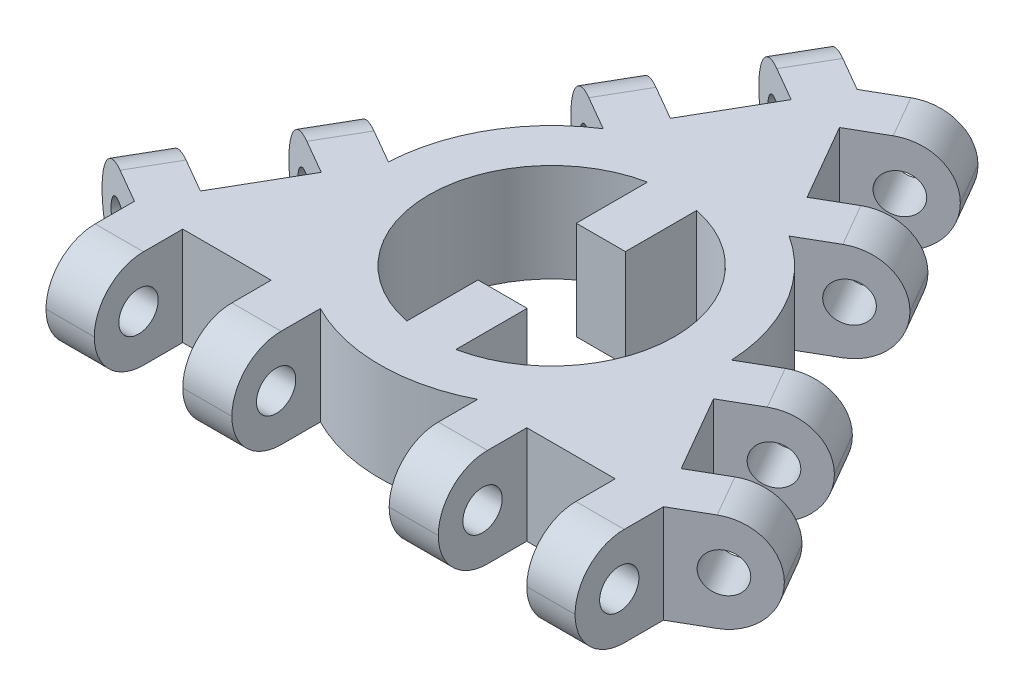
ISO-10303-21;
HEADER;
FILE_DESCRIPTION(('STEP AP214'),'2;1');
FILE_NAME('part.step','',(''),(''),'','','');
FILE_SCHEMA(('AUTOMOTIVE_DESIGN { 1 0 10303 214 1 1 1 1 }'));
ENDSEC;
DATA;
#1=APPLICATION_CONTEXT('core data for automotive mechanical design processes');
#2=APPLICATION_PROTOCOL_DEFINITION('international standard','automotive_design',2000,#1);
#3=PRODUCT_CONTEXT('',#1,'mechanical');
#4=PRODUCT('Part','Part','',(#3));
#5=PRODUCT_RELATED_PRODUCT_CATEGORY('part','',(#4));
#6=PRODUCT_DEFINITION_FORMATION('','',#4);
#7=PRODUCT_DEFINITION_CONTEXT('part definition',#1,'design');
#8=PRODUCT_DEFINITION('design','',#6,#7);
#9=PRODUCT_DEFINITION_SHAPE('','',#8);
#10=(LENGTH_UNIT() NAMED_UNIT(*) SI_UNIT(.MILLI.,.METRE.));
#11=(NAMED_UNIT(*) PLANE_ANGLE_UNIT() SI_UNIT($,.RADIAN.));
#12=(NAMED_UNIT(*) SI_UNIT($,.STERADIAN.) SOLID_ANGLE_UNIT());
#13=UNCERTAINTY_MEASURE_WITH_UNIT(LENGTH_MEASURE(1.E-05),#10,'distance_accuracy_value','');
#14=(GEOMETRIC_REPRESENTATION_CONTEXT(3) GLOBAL_UNCERTAINTY_ASSIGNED_CONTEXT((#13)) GLOBAL_UNIT_ASSIGNED_CONTEXT((#10,
#11,#12)) REPRESENTATION_CONTEXT('',''));
#15=CARTESIAN_POINT('',(0.,0.,0.));
#16=DIRECTION('',(0.,0.,1.));
#17=DIRECTION('',(1.,0.,0.));
#18=AXIS2_PLACEMENT_3D('',#15,#16,#17);
#19=CARTESIAN_POINT('',(0.,0.,-49.0747728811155));
#20=DIRECTION('',(0.,1.,0.));
#21=DIRECTION('',(0.,0.,1.));
#22=AXIS2_PLACEMENT_3D('',#19,#20,#21);
#23=CYLINDRICAL_SURFACE('',#22,25.);
#24=CARTESIAN_POINT('',(0.,20.,-49.0747728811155));
#25=DIRECTION('',(0.,1.,0.));
#26=DIRECTION('',(0.,0.,1.));
#27=AXIS2_PLACEMENT_3D('',#24,#25,#26);
#28=CIRCLE('',#27,25.);
#29=CARTESIAN_POINT('',(-4.99999999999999,20.,-73.5696703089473));
#30=VERTEX_POINT('',#29);
#31=CARTESIAN_POINT('',(-4.99999999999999,20.,-24.5798754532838));
#32=VERTEX_POINT('',#31);
#33=EDGE_CURVE('E634',#30,#32,#28,.T.);
#34=ORIENTED_EDGE('',*,*,#33,.T.);
#35=DIRECTION('',(0.,1.,0.));
#36=VECTOR('',#35,1.);
#37=CARTESIAN_POINT('',(-4.99999999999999,0.,-24.5798754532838));
#38=LINE('',#37,#36);
#39=CARTESIAN_POINT('',(-4.99999999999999,0.,-24.5798754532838));
#40=VERTEX_POINT('',#39);
#41=EDGE_CURVE('E55',#40,#32,#38,.T.);
#42=ORIENTED_EDGE('',*,*,#41,.F.);
#43=CARTESIAN_POINT('',(0.,0.,-49.0747728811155));
#44=DIRECTION('',(0.,1.,0.));
#45=DIRECTION('',(0.,0.,1.));
#46=AXIS2_PLACEMENT_3D('',#43,#44,#45);
#47=CIRCLE('',#46,25.);
#48=CARTESIAN_POINT('',(-4.99999999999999,0.,-73.5696703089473));
#49=VERTEX_POINT('',#48);
#50=EDGE_CURVE('E631',#49,#40,#47,.T.);
#51=ORIENTED_EDGE('',*,*,#50,.F.);
#52=DIRECTION('',(0.,1.,0.));
#53=VECTOR('',#52,1.);
#54=CARTESIAN_POINT('',(-4.99999999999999,0.,-73.5696703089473));
#55=LINE('',#54,#53);
#56=EDGE_CURVE('E484',#49,#30,#55,.T.);
#57=ORIENTED_EDGE('',*,*,#56,.T.);
#58=EDGE_LOOP('',(#34,#42,#51,#57));
#59=FACE_BOUND('',#58,.T.);
#60=ADVANCED_FACE('F32',(#59),#23,.F.);
#61=CARTESIAN_POINT('',(0.,20.,0.));
#62=DIRECTION('',(0.,-1.,0.));
#63=DIRECTION('',(0.,0.,-1.));
#64=AXIS2_PLACEMENT_3D('',#61,#62,#63);
#65=PLANE('',#64);
#66=ORIENTED_EDGE('',*,*,#33,.F.);
#67=DIRECTION('',(0.,0.,1.));
#68=VECTOR('',#67,1.);
#69=CARTESIAN_POINT('',(-4.99999999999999,20.,-59.0747728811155));
#70=LINE('',#69,#68);
#71=CARTESIAN_POINT('',(-4.99999999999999,20.,-59.0747728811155));
#72=VERTEX_POINT('',#71);
#73=EDGE_CURVE('E471',#30,#72,#70,.T.);
#74=ORIENTED_EDGE('',*,*,#73,.T.);
#75=DIRECTION('',(1.,0.,0.));
#76=VECTOR('',#75,1.);
#77=CARTESIAN_POINT('',(5.00000000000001,20.,-59.0747728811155));
#78=LINE('',#77,#76);
#79=CARTESIAN_POINT('',(5.00000000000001,20.,-59.0747728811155));
#80=VERTEX_POINT('',#79);
#81=EDGE_CURVE('E487',#72,#80,#78,.T.);
#82=ORIENTED_EDGE('',*,*,#81,.T.);
#83=DIRECTION('',(0.,0.,-1.));
#84=VECTOR('',#83,1.);
#85=CARTESIAN_POINT('',(5.00000000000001,20.,-59.0747728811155));
#86=LINE('',#85,#84);
#87=CARTESIAN_POINT('',(5.00000000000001,20.,-73.5696703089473));
#88=VERTEX_POINT('',#87);
#89=EDGE_CURVE('E478',#80,#88,#86,.T.);
#90=ORIENTED_EDGE('',*,*,#89,.T.);
#91=CARTESIAN_POINT('',(5.00000000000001,20.,-24.5798754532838));
#92=VERTEX_POINT('',#91);
#93=EDGE_CURVE('E629',#92,#88,#28,.T.);
#94=ORIENTED_EDGE('',*,*,#93,.F.);
#95=DIRECTION('',(0.,0.,-1.));
#96=VECTOR('',#95,1.);
#97=CARTESIAN_POINT('',(5.00000000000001,20.,-39.0747728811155));
#98=LINE('',#97,#96);
#99=CARTESIAN_POINT('',(5.00000000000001,20.,-39.0747728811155));
#100=VERTEX_POINT('',#99);
#101=EDGE_CURVE('E467',#92,#100,#98,.T.);
#102=ORIENTED_EDGE('',*,*,#101,.T.);
#103=DIRECTION('',(-1.,0.,0.));
#104=VECTOR('',#103,1.);
#105=CARTESIAN_POINT('',(-4.99999999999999,20.,-39.0747728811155));
#106=LINE('',#105,#104);
#107=CARTESIAN_POINT('',(-4.99999999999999,20.,-39.0747728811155));
#108=VERTEX_POINT('',#107);
#109=EDGE_CURVE('E445',#100,#108,#106,.T.);
#110=ORIENTED_EDGE('',*,*,#109,.T.);
#111=DIRECTION('',(0.,0.,1.));
#112=VECTOR('',#111,1.);
#113=CARTESIAN_POINT('',(-4.99999999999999,20.,-39.0747728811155));
#114=LINE('',#113,#112);
#115=EDGE_CURVE('E461',#108,#32,#114,.T.);
#116=ORIENTED_EDGE('',*,*,#115,.T.);
#117=EDGE_LOOP('',(#66,#74,#82,#90,#94,#102,#110,#116));
#118=FACE_BOUND('',#117,.T.);
#119=DIRECTION('',(-0.866025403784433,0.,-0.50000000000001));
#120=VECTOR('',#119,1.);
#121=CARTESIAN_POINT('',(48.1615427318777,20.,-83.4182389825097));
#122=LINE('',#121,#120);
#123=CARTESIAN_POINT('',(-1.77635683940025E-12,20.,-111.224318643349));
#124=VERTEX_POINT('',#123);
#125=CARTESIAN_POINT('',(-6.92820323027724,20.,-115.224318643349));
#126=VERTEX_POINT('',#125);
#127=EDGE_CURVE('E633',#124,#126,#122,.T.);
#128=ORIENTED_EDGE('',*,*,#127,.T.);
#129=DIRECTION('',(-0.50000000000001,0.,0.866025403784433));
#130=VECTOR('',#129,1.);
#131=CARTESIAN_POINT('',(-55.089745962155,20.,-31.8060796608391));
#132=LINE('',#131,#130);
#133=CARTESIAN_POINT('',(-11.8397459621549,20.,-106.717277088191));
#134=VERTEX_POINT('',#133);
#135=EDGE_CURVE('E850',#126,#134,#132,.T.);
#136=ORIENTED_EDGE('',*,*,#135,.T.);
#137=DIRECTION('',(-0.866025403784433,0.,-0.50000000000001));
#138=VECTOR('',#137,1.);
#139=CARTESIAN_POINT('',(-4.91154273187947,20.,-102.717277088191));
#140=LINE('',#139,#138);
#141=CARTESIAN_POINT('',(-4.91154273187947,20.,-102.717277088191));
#142=VERTEX_POINT('',#141);
#143=EDGE_CURVE('E686',#142,#134,#140,.T.);
#144=ORIENTED_EDGE('',*,*,#143,.F.);
#145=DIRECTION('',(0.50000000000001,0.,-0.866025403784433));
#146=VECTOR('',#145,1.);
#147=CARTESIAN_POINT('',(-13.9115427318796,20.,-87.1288198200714));
#148=LINE('',#147,#146);
#149=CARTESIAN_POINT('',(-13.9115427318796,20.,-87.1288198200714));
#150=VERTEX_POINT('',#149);
#151=EDGE_CURVE('E676',#150,#142,#148,.T.);
#152=ORIENTED_EDGE('',*,*,#151,.F.);
#153=DIRECTION('',(-0.866025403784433,0.,-0.50000000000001));
#154=VECTOR('',#153,1.);
#155=CARTESIAN_POINT('',(-13.9115427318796,20.,-87.1288198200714));
#156=LINE('',#155,#154);
#157=CARTESIAN_POINT('',(-20.8397459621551,20.,-91.1288198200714));
#158=VERTEX_POINT('',#157);
#159=EDGE_CURVE('E687',#150,#158,#156,.T.);
#160=ORIENTED_EDGE('',*,*,#159,.T.);
#161=DIRECTION('',(-0.50000000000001,0.,0.866025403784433));
#162=VECTOR('',#161,1.);
#163=CARTESIAN_POINT('',(-55.089745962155,20.,-31.8060796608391));
#164=LINE('',#163,#162);
#165=CARTESIAN_POINT('',(-25.8397459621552,20.,-82.4685657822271));
#166=VERTEX_POINT('',#165);
#167=EDGE_CURVE('E847',#158,#166,#164,.T.);
#168=ORIENTED_EDGE('',*,*,#167,.T.);
#169=DIRECTION('',(-0.866025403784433,0.,-0.50000000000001));
#170=VECTOR('',#169,1.);
#171=CARTESIAN_POINT('',(-18.9115427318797,20.,-78.468565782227));
#172=LINE('',#171,#170);
#173=CARTESIAN_POINT('',(-18.9115427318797,20.,-78.468565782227));
#174=VERTEX_POINT('',#173);
#175=EDGE_CURVE('E622',#174,#166,#172,.T.);
#176=ORIENTED_EDGE('',*,*,#175,.F.);
#177=CARTESIAN_POINT('',(0.0467584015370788,20.,-49.0477769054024));
#178=DIRECTION('',(0.,-1.,0.));
#179=DIRECTION('',(0.,0.,1.));
#180=AXIS2_PLACEMENT_3D('',#177,#178,#179);
#181=CIRCLE('',#180,35.);
#182=CARTESIAN_POINT('',(-34.91154273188,20.,-50.7557528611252));
#183=VERTEX_POINT('',#182);
#184=EDGE_CURVE('E608',#183,#174,#181,.T.);
#185=ORIENTED_EDGE('',*,*,#184,.F.);
#186=DIRECTION('',(0.866025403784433,0.,0.50000000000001));
#187=VECTOR('',#186,1.);
#188=CARTESIAN_POINT('',(-34.91154273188,20.,-50.7557528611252));
#189=LINE('',#188,#187);
#190=CARTESIAN_POINT('',(-41.8397459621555,20.,-54.7557528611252));
#191=VERTEX_POINT('',#190);
#192=EDGE_CURVE('E614',#191,#183,#189,.T.);
#193=ORIENTED_EDGE('',*,*,#192,.F.);
#194=DIRECTION('',(-0.50000000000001,0.,0.866025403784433));
#195=VECTOR('',#194,1.);
#196=CARTESIAN_POINT('',(-55.089745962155,20.,-31.8060796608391));
#197=LINE('',#196,#195);
#198=CARTESIAN_POINT('',(-46.8397459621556,20.,-46.0954988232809));
#199=VERTEX_POINT('',#198);
#200=EDGE_CURVE('E844',#191,#199,#197,.T.);
#201=ORIENTED_EDGE('',*,*,#200,.T.);
#202=DIRECTION('',(-0.866025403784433,0.,-0.50000000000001));
#203=VECTOR('',#202,1.);
#204=CARTESIAN_POINT('',(-39.9115427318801,20.,-42.0954988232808));
#205=LINE('',#204,#203);
#206=CARTESIAN_POINT('',(-39.9115427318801,20.,-42.0954988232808));
#207=VERTEX_POINT('',#206);
#208=EDGE_CURVE('E711',#207,#199,#205,.T.);
#209=ORIENTED_EDGE('',*,*,#208,.F.);
#210=DIRECTION('',(0.500000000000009,0.,-0.866025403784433));
#211=VECTOR('',#210,1.);
#212=CARTESIAN_POINT('',(-39.9115427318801,20.,-42.0954988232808));
#213=LINE('',#212,#211);
#214=CARTESIAN_POINT('',(-48.9115427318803,20.,-26.507041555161));
#215=VERTEX_POINT('',#214);
#216=EDGE_CURVE('E707',#215,#207,#213,.T.);
#217=ORIENTED_EDGE('',*,*,#216,.F.);
#218=DIRECTION('',(-0.866025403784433,0.,-0.50000000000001));
#219=VECTOR('',#218,1.);
#220=CARTESIAN_POINT('',(-48.9115427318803,20.,-26.507041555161));
#221=LINE('',#220,#219);
#222=CARTESIAN_POINT('',(-55.8397459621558,20.,-30.5070415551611));
#223=VERTEX_POINT('',#222);
#224=EDGE_CURVE('E715',#215,#223,#221,.T.);
#225=ORIENTED_EDGE('',*,*,#224,.T.);
#226=DIRECTION('',(-0.50000000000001,0.,0.866025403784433));
#227=VECTOR('',#226,1.);
#228=CARTESIAN_POINT('',(-55.089745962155,20.,-31.8060796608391));
#229=LINE('',#228,#227);
#230=CARTESIAN_POINT('',(-60.7512886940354,20.,-22.0000000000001));
#231=VERTEX_POINT('',#230);
#232=EDGE_CURVE('E841',#223,#231,#229,.T.);
#233=ORIENTED_EDGE('',*,*,#232,.T.);
#234=DIRECTION('',(-0.866025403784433,0.,-0.50000000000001));
#235=VECTOR('',#234,1.);
#236=CARTESIAN_POINT('',(-5.66154273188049,20.,9.80607966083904));
#237=LINE('',#236,#235);
#238=CARTESIAN_POINT('',(-53.82308546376,20.,-18.));
#239=VERTEX_POINT('',#238);
#240=EDGE_CURVE('E667',#239,#231,#237,.T.);
#241=ORIENTED_EDGE('',*,*,#240,.F.);
#242=DIRECTION('',(0.,0.,1.));
#243=VECTOR('',#242,1.);
#244=CARTESIAN_POINT('',(-53.8230854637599,20.,3.11227233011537E-13));
#245=LINE('',#244,#243);
#246=CARTESIAN_POINT('',(-53.82308546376,20.,-9.99999999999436));
#247=VERTEX_POINT('',#246);
#248=EDGE_CURVE('E662',#239,#247,#245,.T.);
#249=ORIENTED_EDGE('',*,*,#248,.T.);
#250=DIRECTION('',(1.,0.,0.));
#251=VECTOR('',#250,1.);
#252=CARTESIAN_POINT('',(0.,20.,-9.99999999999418));
#253=LINE('',#252,#251);
#254=CARTESIAN_POINT('',(-43.9999999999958,20.,-9.99999999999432));
#255=VERTEX_POINT('',#254);
#256=EDGE_CURVE('E838',#247,#255,#253,.T.);
#257=ORIENTED_EDGE('',*,*,#256,.T.);
#258=DIRECTION('',(0.,0.,1.));
#259=VECTOR('',#258,1.);
#260=CARTESIAN_POINT('',(-43.9999999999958,20.,-18.));
#261=LINE('',#260,#259);
#262=CARTESIAN_POINT('',(-43.9999999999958,20.,-18.));
#263=VERTEX_POINT('',#262);
#264=EDGE_CURVE('E777',#263,#255,#261,.T.);
#265=ORIENTED_EDGE('',*,*,#264,.F.);
#266=DIRECTION('',(-1.,0.,0.));
#267=VECTOR('',#266,1.);
#268=CARTESIAN_POINT('',(-25.9999999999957,20.,-18.));
#269=LINE('',#268,#267);
#270=CARTESIAN_POINT('',(-25.9999999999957,20.,-18.));
#271=VERTEX_POINT('',#270);
#272=EDGE_CURVE('E759',#271,#263,#269,.T.);
#273=ORIENTED_EDGE('',*,*,#272,.F.);
#274=DIRECTION('',(0.,0.,1.));
#275=VECTOR('',#274,1.);
#276=CARTESIAN_POINT('',(-25.9999999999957,20.,-18.));
#277=LINE('',#276,#275);
#278=CARTESIAN_POINT('',(-25.9999999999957,20.,-9.99999999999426));
#279=VERTEX_POINT('',#278);
#280=EDGE_CURVE('E778',#271,#279,#277,.T.);
#281=ORIENTED_EDGE('',*,*,#280,.T.);
#282=DIRECTION('',(1.,0.,0.));
#283=VECTOR('',#282,1.);
#284=CARTESIAN_POINT('',(0.,20.,-9.99999999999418));
#285=LINE('',#284,#283);
#286=CARTESIAN_POINT('',(-15.9999999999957,20.,-9.99999999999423));
#287=VERTEX_POINT('',#286);
#288=EDGE_CURVE('E835',#279,#287,#285,.T.);
#289=ORIENTED_EDGE('',*,*,#288,.T.);
#290=DIRECTION('',(0.,0.,1.));
#291=VECTOR('',#290,1.);
#292=CARTESIAN_POINT('',(-15.9999999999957,20.,-18.));
#293=LINE('',#292,#291);
#294=CARTESIAN_POINT('',(-15.9999999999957,20.,-18.));
#295=VERTEX_POINT('',#294);
#296=EDGE_CURVE('E580',#295,#287,#293,.T.);
#297=ORIENTED_EDGE('',*,*,#296,.F.);
#298=CARTESIAN_POINT('',(4.24332254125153E-12,20.,-49.1287648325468));
#299=DIRECTION('',(0.,-1.,0.));
#300=DIRECTION('',(0.,0.,1.));
#301=AXIS2_PLACEMENT_3D('',#298,#299,#300);
#302=CIRCLE('',#301,35.);
#303=CARTESIAN_POINT('',(16.0000000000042,20.,-18.));
#304=VERTEX_POINT('',#303);
#305=EDGE_CURVE('E567',#304,#295,#302,.T.);
#306=ORIENTED_EDGE('',*,*,#305,.F.);
#307=DIRECTION('',(0.,0.,-1.));
#308=VECTOR('',#307,1.);
#309=CARTESIAN_POINT('',(16.0000000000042,20.,-18.));
#310=LINE('',#309,#308);
#311=CARTESIAN_POINT('',(16.0000000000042,20.,-9.99999999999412));
#312=VERTEX_POINT('',#311);
#313=EDGE_CURVE('E572',#312,#304,#310,.T.);
#314=ORIENTED_EDGE('',*,*,#313,.F.);
#315=DIRECTION('',(1.,0.,0.));
#316=VECTOR('',#315,1.);
#317=CARTESIAN_POINT('',(0.,20.,-9.99999999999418));
#318=LINE('',#317,#316);
#319=CARTESIAN_POINT('',(26.0000000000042,20.,-9.99999999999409));
#320=VERTEX_POINT('',#319);
#321=EDGE_CURVE('E832',#312,#320,#318,.T.);
#322=ORIENTED_EDGE('',*,*,#321,.T.);
#323=DIRECTION('',(0.,0.,1.));
#324=VECTOR('',#323,1.);
#325=CARTESIAN_POINT('',(26.0000000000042,20.,-18.));
#326=LINE('',#325,#324);
#327=CARTESIAN_POINT('',(26.0000000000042,20.,-18.));
#328=VERTEX_POINT('',#327);
#329=EDGE_CURVE('E799',#328,#320,#326,.T.);
#330=ORIENTED_EDGE('',*,*,#329,.F.);
#331=DIRECTION('',(-1.,0.,0.));
#332=VECTOR('',#331,1.);
#333=CARTESIAN_POINT('',(44.0000000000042,20.,-18.));
#334=LINE('',#333,#332);
#335=CARTESIAN_POINT('',(44.0000000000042,20.,-18.));
#336=VERTEX_POINT('',#335);
#337=EDGE_CURVE('E781',#336,#328,#334,.T.);
#338=ORIENTED_EDGE('',*,*,#337,.F.);
#339=DIRECTION('',(0.,0.,1.));
#340=VECTOR('',#339,1.);
#341=CARTESIAN_POINT('',(44.0000000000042,20.,-18.));
#342=LINE('',#341,#340);
#343=CARTESIAN_POINT('',(44.0000000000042,20.,-9.99999999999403));
#344=VERTEX_POINT('',#343);
#345=EDGE_CURVE('E800',#336,#344,#342,.T.);
#346=ORIENTED_EDGE('',*,*,#345,.T.);
#347=DIRECTION('',(1.,0.,0.));
#348=VECTOR('',#347,1.);
#349=CARTESIAN_POINT('',(0.,20.,-9.99999999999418));
#350=LINE('',#349,#348);
#351=CARTESIAN_POINT('',(53.8230854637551,20.,-9.999999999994));
#352=VERTEX_POINT('',#351);
#353=EDGE_CURVE('E829',#344,#352,#350,.T.);
#354=ORIENTED_EDGE('',*,*,#353,.T.);
#355=DIRECTION('',(0.,0.,1.));
#356=VECTOR('',#355,1.);
#357=CARTESIAN_POINT('',(53.8230854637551,20.,-18.));
#358=LINE('',#357,#356);
#359=CARTESIAN_POINT('',(53.8230854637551,20.,-18.));
#360=VERTEX_POINT('',#359);
#361=EDGE_CURVE('E653',#360,#352,#358,.T.);
#362=ORIENTED_EDGE('',*,*,#361,.F.);
#363=DIRECTION('',(-0.866025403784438,0.,0.5));
#364=VECTOR('',#363,1.);
#365=CARTESIAN_POINT('',(53.8230854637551,20.,-18.));
#366=LINE('',#365,#364);
#367=CARTESIAN_POINT('',(60.7512886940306,20.,-22.));
#368=VERTEX_POINT('',#367);
#369=EDGE_CURVE('E649',#368,#360,#366,.T.);
#370=ORIENTED_EDGE('',*,*,#369,.F.);
#371=DIRECTION('',(-0.5,0.,-0.866025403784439));
#372=VECTOR('',#371,1.);
#373=CARTESIAN_POINT('',(55.0897459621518,20.,-31.8060796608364));
#374=LINE('',#373,#372);
#375=CARTESIAN_POINT('',(55.8397459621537,20.,-30.5070415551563));
#376=VERTEX_POINT('',#375);
#377=EDGE_CURVE('E826',#368,#376,#374,.T.);
#378=ORIENTED_EDGE('',*,*,#377,.T.);
#379=DIRECTION('',(0.866025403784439,0.,-0.5));
#380=VECTOR('',#379,1.);
#381=CARTESIAN_POINT('',(48.9115427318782,20.,-26.5070415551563));
#382=LINE('',#381,#380);
#383=CARTESIAN_POINT('',(48.9115427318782,20.,-26.5070415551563));
#384=VERTEX_POINT('',#383);
#385=EDGE_CURVE('E732',#384,#376,#382,.T.);
#386=ORIENTED_EDGE('',*,*,#385,.F.);
#387=DIRECTION('',(0.5,0.,0.866025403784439));
#388=VECTOR('',#387,1.);
#389=CARTESIAN_POINT('',(39.9115427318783,20.,-42.0954988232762));
#390=LINE('',#389,#388);
#391=CARTESIAN_POINT('',(39.9115427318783,20.,-42.0954988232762));
#392=VERTEX_POINT('',#391);
#393=EDGE_CURVE('E714',#392,#384,#390,.T.);
#394=ORIENTED_EDGE('',*,*,#393,.F.);
#395=DIRECTION('',(0.866025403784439,0.,-0.5));
#396=VECTOR('',#395,1.);
#397=CARTESIAN_POINT('',(39.9115427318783,20.,-42.0954988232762));
#398=LINE('',#397,#396);
#399=CARTESIAN_POINT('',(46.8397459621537,20.,-46.0954988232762));
#400=VERTEX_POINT('',#399);
#401=EDGE_CURVE('E733',#392,#400,#398,.T.);
#402=ORIENTED_EDGE('',*,*,#401,.T.);
#403=DIRECTION('',(-0.5,0.,-0.866025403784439));
#404=VECTOR('',#403,1.);
#405=CARTESIAN_POINT('',(55.0897459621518,20.,-31.8060796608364));
#406=LINE('',#405,#404);
#407=CARTESIAN_POINT('',(41.8397459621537,20.,-54.7557528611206));
#408=VERTEX_POINT('',#407);
#409=EDGE_CURVE('E823',#400,#408,#406,.T.);
#410=ORIENTED_EDGE('',*,*,#409,.T.);
#411=DIRECTION('',(0.866025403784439,0.,-0.5));
#412=VECTOR('',#411,1.);
#413=CARTESIAN_POINT('',(34.9115427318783,20.,-50.7557528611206));
#414=LINE('',#413,#412);
#415=CARTESIAN_POINT('',(34.9115427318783,20.,-50.7557528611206));
#416=VERTEX_POINT('',#415);
#417=EDGE_CURVE('E601',#416,#408,#414,.T.);
#418=ORIENTED_EDGE('',*,*,#417,.F.);
#419=CARTESIAN_POINT('',(-0.0467584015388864,20.,-49.0477769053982));
#420=DIRECTION('',(0.,-1.,0.));
#421=DIRECTION('',(0.,0.,1.));
#422=AXIS2_PLACEMENT_3D('',#419,#420,#421);
#423=CIRCLE('',#422,35.);
#424=CARTESIAN_POINT('',(18.9115427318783,20.,-78.4685657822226));
#425=VERTEX_POINT('',#424);
#426=EDGE_CURVE('E587',#425,#416,#423,.T.);
#427=ORIENTED_EDGE('',*,*,#426,.F.);
#428=DIRECTION('',(-0.866025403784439,0.,0.5));
#429=VECTOR('',#428,1.);
#430=CARTESIAN_POINT('',(18.9115427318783,20.,-78.4685657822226));
#431=LINE('',#430,#429);
#432=CARTESIAN_POINT('',(25.8397459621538,20.,-82.4685657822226));
#433=VERTEX_POINT('',#432);
#434=EDGE_CURVE('E593',#433,#425,#431,.T.);
#435=ORIENTED_EDGE('',*,*,#434,.F.);
#436=DIRECTION('',(-0.5,0.,-0.866025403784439));
#437=VECTOR('',#436,1.);
#438=CARTESIAN_POINT('',(55.0897459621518,20.,-31.8060796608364));
#439=LINE('',#438,#437);
#440=CARTESIAN_POINT('',(20.8397459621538,20.,-91.128819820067));
#441=VERTEX_POINT('',#440);
#442=EDGE_CURVE('E820',#433,#441,#439,.T.);
#443=ORIENTED_EDGE('',*,*,#442,.T.);
#444=DIRECTION('',(0.866025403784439,0.,-0.5));
#445=VECTOR('',#444,1.);
#446=CARTESIAN_POINT('',(13.9115427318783,20.,-87.128819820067));
#447=LINE('',#446,#445);
#448=CARTESIAN_POINT('',(13.9115427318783,20.,-87.128819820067));
#449=VERTEX_POINT('',#448);
#450=EDGE_CURVE('E756',#449,#441,#447,.T.);
#451=ORIENTED_EDGE('',*,*,#450,.F.);
#452=DIRECTION('',(0.5,0.,0.866025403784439));
#453=VECTOR('',#452,1.);
#454=CARTESIAN_POINT('',(13.9115427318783,20.,-87.128819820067));
#455=LINE('',#454,#453);
#456=CARTESIAN_POINT('',(4.91154273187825,20.,-102.717277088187));
#457=VERTEX_POINT('',#456);
#458=EDGE_CURVE('E752',#457,#449,#455,.T.);
#459=ORIENTED_EDGE('',*,*,#458,.F.);
#460=DIRECTION('',(0.866025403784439,0.,-0.5));
#461=VECTOR('',#460,1.);
#462=CARTESIAN_POINT('',(4.91154273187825,20.,-102.717277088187));
#463=LINE('',#462,#461);
#464=CARTESIAN_POINT('',(11.8397459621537,20.,-106.717277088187));
#465=VERTEX_POINT('',#464);
#466=EDGE_CURVE('E760',#457,#465,#463,.T.);
#467=ORIENTED_EDGE('',*,*,#466,.T.);
#468=DIRECTION('',(-0.5,0.,-0.866025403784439));
#469=VECTOR('',#468,1.);
#470=CARTESIAN_POINT('',(55.0897459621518,20.,-31.8060796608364));
#471=LINE('',#470,#469);
#472=CARTESIAN_POINT('',(6.92820323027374,20.,-115.224318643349));
#473=VERTEX_POINT('',#472);
#474=EDGE_CURVE('E803',#465,#473,#471,.T.);
#475=ORIENTED_EDGE('',*,*,#474,.T.);
#476=DIRECTION('',(0.866025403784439,0.,-0.5));
#477=VECTOR('',#476,1.);
#478=CARTESIAN_POINT('',(-48.161542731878,20.,-83.4182389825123));
#479=LINE('',#478,#477);
#480=EDGE_CURVE('E640',#124,#473,#479,.T.);
#481=ORIENTED_EDGE('',*,*,#480,.F.);
#482=EDGE_LOOP('',(#128,#136,#144,#152,#160,#168,#176,#185,#193,#201,#209,#217,#225,#233,#241,
#249,#257,#265,#273,#281,#289,#297,#306,#314,#322,#330,#338,#346,#354,#362,#370,#378,#386,#394,
#402,#410,#418,#427,#435,#443,#451,#459,#467,#475,#481));
#483=FACE_BOUND('',#482,.T.);
#484=ADVANCED_FACE('F1034',(#118,#483),#65,.F.);
#485=CARTESIAN_POINT('',(0.,0.,0.));
#486=DIRECTION('',(0.,-1.,0.));
#487=DIRECTION('',(0.,0.,-1.));
#488=AXIS2_PLACEMENT_3D('',#485,#486,#487);
#489=PLANE('',#488);
#490=DIRECTION('',(0.,0.,1.));
#491=VECTOR('',#490,1.);
#492=CARTESIAN_POINT('',(-43.9999999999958,0.,-18.));
#493=LINE('',#492,#491);
#494=CARTESIAN_POINT('',(-43.9999999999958,0.,-18.));
#495=VERTEX_POINT('',#494);
#496=CARTESIAN_POINT('',(-43.9999999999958,0.,-9.99999999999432));
#497=VERTEX_POINT('',#496);
#498=EDGE_CURVE('E785',#495,#497,#493,.T.);
#499=ORIENTED_EDGE('',*,*,#498,.T.);
#500=DIRECTION('',(1.,0.,0.));
#501=VECTOR('',#500,1.);
#502=CARTESIAN_POINT('',(-53.8230854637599,0.,-9.99999999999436));
#503=LINE('',#502,#501);
#504=CARTESIAN_POINT('',(-53.82308546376,0.,-9.99999999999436));
#505=VERTEX_POINT('',#504);
#506=EDGE_CURVE('E973',#497,#505,#503,.F.);
#507=ORIENTED_EDGE('',*,*,#506,.T.);
#508=DIRECTION('',(0.,0.,1.));
#509=VECTOR('',#508,1.);
#510=CARTESIAN_POINT('',(-53.8230854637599,0.,3.11227233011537E-13));
#511=LINE('',#510,#509);
#512=CARTESIAN_POINT('',(-53.82308546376,0.,-18.));
#513=VERTEX_POINT('',#512);
#514=EDGE_CURVE('E663',#513,#505,#511,.T.);
#515=ORIENTED_EDGE('',*,*,#514,.F.);
#516=DIRECTION('',(-0.866025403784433,0.,-0.50000000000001));
#517=VECTOR('',#516,1.);
#518=CARTESIAN_POINT('',(-5.66154273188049,0.,9.80607966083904));
#519=LINE('',#518,#517);
#520=CARTESIAN_POINT('',(-60.7512886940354,0.,-22.0000000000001));
#521=VERTEX_POINT('',#520);
#522=EDGE_CURVE('E666',#513,#521,#519,.T.);
#523=ORIENTED_EDGE('',*,*,#522,.T.);
#524=DIRECTION('',(-0.50000000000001,0.,0.866025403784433));
#525=VECTOR('',#524,1.);
#526=CARTESIAN_POINT('',(-55.8397459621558,0.,-30.507041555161));
#527=LINE('',#526,#525);
#528=CARTESIAN_POINT('',(-55.8397459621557,0.,-30.5070415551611));
#529=VERTEX_POINT('',#528);
#530=EDGE_CURVE('E959',#521,#529,#527,.F.);
#531=ORIENTED_EDGE('',*,*,#530,.T.);
#532=DIRECTION('',(-0.866025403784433,0.,-0.50000000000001));
#533=VECTOR('',#532,1.);
#534=CARTESIAN_POINT('',(-48.9115427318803,0.,-26.5070415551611));
#535=LINE('',#534,#533);
#536=CARTESIAN_POINT('',(-48.9115427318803,0.,-26.5070415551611));
#537=VERTEX_POINT('',#536);
#538=EDGE_CURVE('E718',#537,#529,#535,.T.);
#539=ORIENTED_EDGE('',*,*,#538,.F.);
#540=DIRECTION('',(-0.50000000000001,0.,0.866025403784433));
#541=VECTOR('',#540,1.);
#542=CARTESIAN_POINT('',(-48.9115427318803,0.,-26.5070415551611));
#543=LINE('',#542,#541);
#544=CARTESIAN_POINT('',(-39.9115427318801,0.,-42.0954988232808));
#545=VERTEX_POINT('',#544);
#546=EDGE_CURVE('E701',#545,#537,#543,.T.);
#547=ORIENTED_EDGE('',*,*,#546,.F.);
#548=DIRECTION('',(-0.866025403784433,0.,-0.50000000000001));
#549=VECTOR('',#548,1.);
#550=CARTESIAN_POINT('',(-39.9115427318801,0.,-42.0954988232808));
#551=LINE('',#550,#549);
#552=CARTESIAN_POINT('',(-46.8397459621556,0.,-46.0954988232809));
#553=VERTEX_POINT('',#552);
#554=EDGE_CURVE('E710',#545,#553,#551,.T.);
#555=ORIENTED_EDGE('',*,*,#554,.T.);
#556=DIRECTION('',(-0.50000000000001,0.,0.866025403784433));
#557=VECTOR('',#556,1.);
#558=CARTESIAN_POINT('',(-41.8397459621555,0.,-54.7557528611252));
#559=LINE('',#558,#557);
#560=CARTESIAN_POINT('',(-41.8397459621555,0.,-54.7557528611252));
#561=VERTEX_POINT('',#560);
#562=EDGE_CURVE('E957',#553,#561,#559,.F.);
#563=ORIENTED_EDGE('',*,*,#562,.T.);
#564=DIRECTION('',(0.866025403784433,0.,0.50000000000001));
#565=VECTOR('',#564,1.);
#566=CARTESIAN_POINT('',(-34.91154273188,0.,-50.7557528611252));
#567=LINE('',#566,#565);
#568=CARTESIAN_POINT('',(-34.91154273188,0.,-50.7557528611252));
#569=VERTEX_POINT('',#568);
#570=EDGE_CURVE('E617',#561,#569,#567,.T.);
#571=ORIENTED_EDGE('',*,*,#570,.T.);
#572=CARTESIAN_POINT('',(0.0467584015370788,0.,-49.0477769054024));
#573=DIRECTION('',(0.,-1.,0.));
#574=DIRECTION('',(0.,0.,1.));
#575=AXIS2_PLACEMENT_3D('',#572,#573,#574);
#576=CIRCLE('',#575,35.);
#577=CARTESIAN_POINT('',(-18.9115427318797,0.,-78.468565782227));
#578=VERTEX_POINT('',#577);
#579=EDGE_CURVE('E610',#569,#578,#576,.T.);
#580=ORIENTED_EDGE('',*,*,#579,.T.);
#581=DIRECTION('',(-0.866025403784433,0.,-0.50000000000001));
#582=VECTOR('',#581,1.);
#583=CARTESIAN_POINT('',(-18.9115427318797,0.,-78.468565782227));
#584=LINE('',#583,#582);
#585=CARTESIAN_POINT('',(-25.8397459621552,0.,-82.4685657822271));
#586=VERTEX_POINT('',#585);
#587=EDGE_CURVE('E613',#578,#586,#584,.T.);
#588=ORIENTED_EDGE('',*,*,#587,.T.);
#589=DIRECTION('',(-0.50000000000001,0.,0.866025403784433));
#590=VECTOR('',#589,1.);
#591=CARTESIAN_POINT('',(-20.8397459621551,0.,-91.1288198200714));
#592=LINE('',#591,#590);
#593=CARTESIAN_POINT('',(-20.8397459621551,0.,-91.1288198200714));
#594=VERTEX_POINT('',#593);
#595=EDGE_CURVE('E955',#586,#594,#592,.F.);
#596=ORIENTED_EDGE('',*,*,#595,.T.);
#597=DIRECTION('',(-0.866025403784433,0.,-0.50000000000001));
#598=VECTOR('',#597,1.);
#599=CARTESIAN_POINT('',(-13.9115427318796,0.,-87.1288198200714));
#600=LINE('',#599,#598);
#601=CARTESIAN_POINT('',(-13.9115427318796,0.,-87.1288198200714));
#602=VERTEX_POINT('',#601);
#603=EDGE_CURVE('E691',#602,#594,#600,.T.);
#604=ORIENTED_EDGE('',*,*,#603,.F.);
#605=DIRECTION('',(-0.50000000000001,0.,0.866025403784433));
#606=VECTOR('',#605,1.);
#607=CARTESIAN_POINT('',(-4.91154273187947,0.,-102.717277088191));
#608=LINE('',#607,#606);
#609=CARTESIAN_POINT('',(-4.91154273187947,0.,-102.717277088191));
#610=VERTEX_POINT('',#609);
#611=EDGE_CURVE('E681',#610,#602,#608,.T.);
#612=ORIENTED_EDGE('',*,*,#611,.F.);
#613=DIRECTION('',(-0.866025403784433,0.,-0.50000000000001));
#614=VECTOR('',#613,1.);
#615=CARTESIAN_POINT('',(-4.91154273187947,0.,-102.717277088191));
#616=LINE('',#615,#614);
#617=CARTESIAN_POINT('',(-11.8397459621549,0.,-106.717277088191));
#618=VERTEX_POINT('',#617);
#619=EDGE_CURVE('E694',#610,#618,#616,.T.);
#620=ORIENTED_EDGE('',*,*,#619,.T.);
#621=DIRECTION('',(-0.50000000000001,0.,0.866025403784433));
#622=VECTOR('',#621,1.);
#623=CARTESIAN_POINT('',(-6.92820323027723,0.,-115.224318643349));
#624=LINE('',#623,#622);
#625=CARTESIAN_POINT('',(-6.92820323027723,0.,-115.224318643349));
#626=VERTEX_POINT('',#625);
#627=EDGE_CURVE('E953',#618,#626,#624,.F.);
#628=ORIENTED_EDGE('',*,*,#627,.T.);
#629=DIRECTION('',(-0.866025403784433,0.,-0.50000000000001));
#630=VECTOR('',#629,1.);
#631=CARTESIAN_POINT('',(48.1615427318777,0.,-83.4182389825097));
#632=LINE('',#631,#630);
#633=CARTESIAN_POINT('',(-1.77635683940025E-12,0.,-111.224318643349));
#634=VERTEX_POINT('',#633);
#635=EDGE_CURVE('E636',#634,#626,#632,.T.);
#636=ORIENTED_EDGE('',*,*,#635,.F.);
#637=DIRECTION('',(0.866025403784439,0.,-0.5));
#638=VECTOR('',#637,1.);
#639=CARTESIAN_POINT('',(-48.161542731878,0.,-83.4182389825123));
#640=LINE('',#639,#638);
#641=CARTESIAN_POINT('',(6.92820323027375,0.,-115.224318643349));
#642=VERTEX_POINT('',#641);
#643=EDGE_CURVE('E639',#634,#642,#640,.T.);
#644=ORIENTED_EDGE('',*,*,#643,.T.);
#645=DIRECTION('',(-0.5,0.,-0.866025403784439));
#646=VECTOR('',#645,1.);
#647=CARTESIAN_POINT('',(11.8397459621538,0.,-106.717277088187));
#648=LINE('',#647,#646);
#649=CARTESIAN_POINT('',(11.8397459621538,0.,-106.717277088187));
#650=VERTEX_POINT('',#649);
#651=EDGE_CURVE('E951',#642,#650,#648,.F.);
#652=ORIENTED_EDGE('',*,*,#651,.T.);
#653=DIRECTION('',(0.866025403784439,0.,-0.5));
#654=VECTOR('',#653,1.);
#655=CARTESIAN_POINT('',(4.91154273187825,0.,-102.717277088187));
#656=LINE('',#655,#654);
#657=CARTESIAN_POINT('',(4.91154273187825,0.,-102.717277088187));
#658=VERTEX_POINT('',#657);
#659=EDGE_CURVE('E763',#658,#650,#656,.T.);
#660=ORIENTED_EDGE('',*,*,#659,.F.);
#661=DIRECTION('',(-0.5,0.,-0.866025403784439));
#662=VECTOR('',#661,1.);
#663=CARTESIAN_POINT('',(4.91154273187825,0.,-102.717277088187));
#664=LINE('',#663,#662);
#665=CARTESIAN_POINT('',(13.9115427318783,0.,-87.128819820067));
#666=VERTEX_POINT('',#665);
#667=EDGE_CURVE('E746',#666,#658,#664,.T.);
#668=ORIENTED_EDGE('',*,*,#667,.F.);
#669=DIRECTION('',(0.866025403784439,0.,-0.5));
#670=VECTOR('',#669,1.);
#671=CARTESIAN_POINT('',(13.9115427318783,0.,-87.128819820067));
#672=LINE('',#671,#670);
#673=CARTESIAN_POINT('',(20.8397459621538,0.,-91.128819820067));
#674=VERTEX_POINT('',#673);
#675=EDGE_CURVE('E755',#666,#674,#672,.T.);
#676=ORIENTED_EDGE('',*,*,#675,.T.);
#677=DIRECTION('',(-0.5,0.,-0.866025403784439));
#678=VECTOR('',#677,1.);
#679=CARTESIAN_POINT('',(25.8397459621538,0.,-82.4685657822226));
#680=LINE('',#679,#678);
#681=CARTESIAN_POINT('',(25.8397459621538,0.,-82.4685657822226));
#682=VERTEX_POINT('',#681);
#683=EDGE_CURVE('E961',#674,#682,#680,.F.);
#684=ORIENTED_EDGE('',*,*,#683,.T.);
#685=DIRECTION('',(-0.866025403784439,0.,0.5));
#686=VECTOR('',#685,1.);
#687=CARTESIAN_POINT('',(18.9115427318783,0.,-78.4685657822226));
#688=LINE('',#687,#686);
#689=CARTESIAN_POINT('',(18.9115427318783,0.,-78.4685657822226));
#690=VERTEX_POINT('',#689);
#691=EDGE_CURVE('E596',#682,#690,#688,.T.);
#692=ORIENTED_EDGE('',*,*,#691,.T.);
#693=CARTESIAN_POINT('',(-0.0467584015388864,0.,-49.0477769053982));
#694=DIRECTION('',(0.,-1.,0.));
#695=DIRECTION('',(0.,0.,1.));
#696=AXIS2_PLACEMENT_3D('',#693,#694,#695);
#697=CIRCLE('',#696,35.);
#698=CARTESIAN_POINT('',(34.9115427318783,0.,-50.7557528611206));
#699=VERTEX_POINT('',#698);
#700=EDGE_CURVE('E589',#690,#699,#697,.T.);
#701=ORIENTED_EDGE('',*,*,#700,.T.);
#702=DIRECTION('',(0.866025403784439,0.,-0.5));
#703=VECTOR('',#702,1.);
#704=CARTESIAN_POINT('',(34.9115427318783,0.,-50.7557528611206));
#705=LINE('',#704,#703);
#706=CARTESIAN_POINT('',(41.8397459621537,0.,-54.7557528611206));
#707=VERTEX_POINT('',#706);
#708=EDGE_CURVE('E592',#699,#707,#705,.T.);
#709=ORIENTED_EDGE('',*,*,#708,.T.);
#710=DIRECTION('',(-0.5,0.,-0.866025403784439));
#711=VECTOR('',#710,1.);
#712=CARTESIAN_POINT('',(46.8397459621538,0.,-46.0954988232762));
#713=LINE('',#712,#711);
#714=CARTESIAN_POINT('',(46.8397459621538,0.,-46.0954988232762));
#715=VERTEX_POINT('',#714);
#716=EDGE_CURVE('E963',#707,#715,#713,.F.);
#717=ORIENTED_EDGE('',*,*,#716,.T.);
#718=DIRECTION('',(0.866025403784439,0.,-0.5));
#719=VECTOR('',#718,1.);
#720=CARTESIAN_POINT('',(39.9115427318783,0.,-42.0954988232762));
#721=LINE('',#720,#719);
#722=CARTESIAN_POINT('',(39.9115427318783,0.,-42.0954988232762));
#723=VERTEX_POINT('',#722);
#724=EDGE_CURVE('E737',#723,#715,#721,.T.);
#725=ORIENTED_EDGE('',*,*,#724,.F.);
#726=DIRECTION('',(-0.5,0.,-0.866025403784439));
#727=VECTOR('',#726,1.);
#728=CARTESIAN_POINT('',(48.9115427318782,0.,-26.5070415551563));
#729=LINE('',#728,#727);
#730=CARTESIAN_POINT('',(48.9115427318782,0.,-26.5070415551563));
#731=VERTEX_POINT('',#730);
#732=EDGE_CURVE('E727',#731,#723,#729,.T.);
#733=ORIENTED_EDGE('',*,*,#732,.F.);
#734=DIRECTION('',(0.866025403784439,0.,-0.5));
#735=VECTOR('',#734,1.);
#736=CARTESIAN_POINT('',(48.9115427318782,0.,-26.5070415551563));
#737=LINE('',#736,#735);
#738=CARTESIAN_POINT('',(55.8397459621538,0.,-30.5070415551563));
#739=VERTEX_POINT('',#738);
#740=EDGE_CURVE('E740',#731,#739,#737,.T.);
#741=ORIENTED_EDGE('',*,*,#740,.T.);
#742=DIRECTION('',(-0.5,0.,-0.866025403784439));
#743=VECTOR('',#742,1.);
#744=CARTESIAN_POINT('',(60.7512886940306,0.,-22.));
#745=LINE('',#744,#743);
#746=CARTESIAN_POINT('',(60.7512886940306,0.,-22.));
#747=VERTEX_POINT('',#746);
#748=EDGE_CURVE('E965',#739,#747,#745,.F.);
#749=ORIENTED_EDGE('',*,*,#748,.T.);
#750=DIRECTION('',(-0.866025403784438,0.,0.5));
#751=VECTOR('',#750,1.);
#752=CARTESIAN_POINT('',(53.8230854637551,0.,-18.));
#753=LINE('',#752,#751);
#754=CARTESIAN_POINT('',(53.8230854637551,0.,-18.));
#755=VERTEX_POINT('',#754);
#756=EDGE_CURVE('E650',#747,#755,#753,.T.);
#757=ORIENTED_EDGE('',*,*,#756,.T.);
#758=DIRECTION('',(0.,0.,1.));
#759=VECTOR('',#758,1.);
#760=CARTESIAN_POINT('',(53.8230854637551,0.,-18.));
#761=LINE('',#760,#759);
#762=CARTESIAN_POINT('',(53.8230854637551,0.,-9.999999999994));
#763=VERTEX_POINT('',#762);
#764=EDGE_CURVE('E652',#755,#763,#761,.T.);
#765=ORIENTED_EDGE('',*,*,#764,.T.);
#766=DIRECTION('',(1.,0.,0.));
#767=VECTOR('',#766,1.);
#768=CARTESIAN_POINT('',(44.0000000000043,0.,-9.99999999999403));
#769=LINE('',#768,#767);
#770=CARTESIAN_POINT('',(44.0000000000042,0.,-9.99999999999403));
#771=VERTEX_POINT('',#770);
#772=EDGE_CURVE('E967',#763,#771,#769,.F.);
#773=ORIENTED_EDGE('',*,*,#772,.T.);
#774=DIRECTION('',(0.,0.,1.));
#775=VECTOR('',#774,1.);
#776=CARTESIAN_POINT('',(44.0000000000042,0.,-18.));
#777=LINE('',#776,#775);
#778=CARTESIAN_POINT('',(44.0000000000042,0.,-18.));
#779=VERTEX_POINT('',#778);
#780=EDGE_CURVE('E804',#779,#771,#777,.T.);
#781=ORIENTED_EDGE('',*,*,#780,.F.);
#782=DIRECTION('',(1.,0.,0.));
#783=VECTOR('',#782,1.);
#784=CARTESIAN_POINT('',(26.0000000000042,0.,-18.));
#785=LINE('',#784,#783);
#786=CARTESIAN_POINT('',(26.0000000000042,0.,-18.));
#787=VERTEX_POINT('',#786);
#788=EDGE_CURVE('E794',#787,#779,#785,.T.);
#789=ORIENTED_EDGE('',*,*,#788,.F.);
#790=DIRECTION('',(0.,0.,1.));
#791=VECTOR('',#790,1.);
#792=CARTESIAN_POINT('',(26.0000000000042,0.,-18.));
#793=LINE('',#792,#791);
#794=CARTESIAN_POINT('',(26.0000000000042,0.,-9.99999999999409));
#795=VERTEX_POINT('',#794);
#796=EDGE_CURVE('E807',#787,#795,#793,.T.);
#797=ORIENTED_EDGE('',*,*,#796,.T.);
#798=DIRECTION('',(1.,0.,0.));
#799=VECTOR('',#798,1.);
#800=CARTESIAN_POINT('',(16.0000000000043,0.,-9.99999999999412));
#801=LINE('',#800,#799);
#802=CARTESIAN_POINT('',(16.0000000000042,0.,-9.99999999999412));
#803=VERTEX_POINT('',#802);
#804=EDGE_CURVE('E969',#795,#803,#801,.F.);
#805=ORIENTED_EDGE('',*,*,#804,.T.);
#806=DIRECTION('',(0.,0.,-1.));
#807=VECTOR('',#806,1.);
#808=CARTESIAN_POINT('',(16.0000000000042,0.,-18.));
#809=LINE('',#808,#807);
#810=CARTESIAN_POINT('',(16.0000000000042,0.,-18.));
#811=VERTEX_POINT('',#810);
#812=EDGE_CURVE('E575',#803,#811,#809,.T.);
#813=ORIENTED_EDGE('',*,*,#812,.T.);
#814=CARTESIAN_POINT('',(4.24332254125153E-12,0.,-49.1287648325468));
#815=DIRECTION('',(0.,-1.,0.));
#816=DIRECTION('',(0.,0.,1.));
#817=AXIS2_PLACEMENT_3D('',#814,#815,#816);
#818=CIRCLE('',#817,35.);
#819=CARTESIAN_POINT('',(-15.9999999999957,0.,-18.));
#820=VERTEX_POINT('',#819);
#821=EDGE_CURVE('E568',#811,#820,#818,.T.);
#822=ORIENTED_EDGE('',*,*,#821,.T.);
#823=DIRECTION('',(0.,0.,1.));
#824=VECTOR('',#823,1.);
#825=CARTESIAN_POINT('',(-15.9999999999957,0.,-18.));
#826=LINE('',#825,#824);
#827=CARTESIAN_POINT('',(-15.9999999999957,0.,-9.99999999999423));
#828=VERTEX_POINT('',#827);
#829=EDGE_CURVE('E571',#820,#828,#826,.T.);
#830=ORIENTED_EDGE('',*,*,#829,.T.);
#831=DIRECTION('',(1.,0.,0.));
#832=VECTOR('',#831,1.);
#833=CARTESIAN_POINT('',(-25.9999999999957,0.,-9.99999999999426));
#834=LINE('',#833,#832);
#835=CARTESIAN_POINT('',(-25.9999999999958,0.,-9.99999999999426));
#836=VERTEX_POINT('',#835);
#837=EDGE_CURVE('E971',#828,#836,#834,.F.);
#838=ORIENTED_EDGE('',*,*,#837,.T.);
#839=DIRECTION('',(0.,0.,1.));
#840=VECTOR('',#839,1.);
#841=CARTESIAN_POINT('',(-25.9999999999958,0.,-18.));
#842=LINE('',#841,#840);
#843=CARTESIAN_POINT('',(-25.9999999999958,0.,-18.));
#844=VERTEX_POINT('',#843);
#845=EDGE_CURVE('E782',#844,#836,#842,.T.);
#846=ORIENTED_EDGE('',*,*,#845,.F.);
#847=DIRECTION('',(1.,0.,0.));
#848=VECTOR('',#847,1.);
#849=CARTESIAN_POINT('',(-43.9999999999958,0.,-18.));
#850=LINE('',#849,#848);
#851=EDGE_CURVE('E772',#495,#844,#850,.T.);
#852=ORIENTED_EDGE('',*,*,#851,.F.);
#853=EDGE_LOOP('',(#499,#507,#515,#523,#531,#539,#547,#555,#563,#571,#580,#588,#596,#604,#612,
#620,#628,#636,#644,#652,#660,#668,#676,#684,#692,#701,#709,#717,#725,#733,#741,#749,#757,#765,
#773,#781,#789,#797,#805,#813,#822,#830,#838,#846,#852));
#854=FACE_BOUND('',#853,.T.);
#855=ORIENTED_EDGE('',*,*,#50,.T.);
#856=DIRECTION('',(0.,0.,1.));
#857=VECTOR('',#856,1.);
#858=CARTESIAN_POINT('',(-4.99999999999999,0.,-39.0747728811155));
#859=LINE('',#858,#857);
#860=CARTESIAN_POINT('',(-4.99999999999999,0.,-39.0747728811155));
#861=VERTEX_POINT('',#860);
#862=EDGE_CURVE('E458',#861,#40,#859,.T.);
#863=ORIENTED_EDGE('',*,*,#862,.F.);
#864=DIRECTION('',(-1.,0.,0.));
#865=VECTOR('',#864,1.);
#866=CARTESIAN_POINT('',(-4.99999999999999,0.,-39.0747728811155));
#867=LINE('',#866,#865);
#868=CARTESIAN_POINT('',(5.00000000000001,0.,-39.0747728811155));
#869=VERTEX_POINT('',#868);
#870=EDGE_CURVE('E442',#869,#861,#867,.T.);
#871=ORIENTED_EDGE('',*,*,#870,.F.);
#872=DIRECTION('',(0.,0.,-1.));
#873=VECTOR('',#872,1.);
#874=CARTESIAN_POINT('',(5.00000000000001,0.,-39.0747728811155));
#875=LINE('',#874,#873);
#876=CARTESIAN_POINT('',(5.00000000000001,0.,-24.5798754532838));
#877=VERTEX_POINT('',#876);
#878=EDGE_CURVE('E456',#877,#869,#875,.T.);
#879=ORIENTED_EDGE('',*,*,#878,.F.);
#880=CARTESIAN_POINT('',(5.00000000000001,0.,-73.5696703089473));
#881=VERTEX_POINT('',#880);
#882=EDGE_CURVE('E47',#877,#881,#47,.T.);
#883=ORIENTED_EDGE('',*,*,#882,.T.);
#884=DIRECTION('',(0.,0.,-1.));
#885=VECTOR('',#884,1.);
#886=CARTESIAN_POINT('',(5.00000000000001,0.,-59.0747728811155));
#887=LINE('',#886,#885);
#888=CARTESIAN_POINT('',(5.00000000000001,0.,-59.0747728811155));
#889=VERTEX_POINT('',#888);
#890=EDGE_CURVE('E481',#889,#881,#887,.T.);
#891=ORIENTED_EDGE('',*,*,#890,.F.);
#892=DIRECTION('',(1.,0.,0.));
#893=VECTOR('',#892,1.);
#894=CARTESIAN_POINT('',(5.00000000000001,0.,-59.0747728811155));
#895=LINE('',#894,#893);
#896=CARTESIAN_POINT('',(-4.99999999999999,0.,-59.0747728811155));
#897=VERTEX_POINT('',#896);
#898=EDGE_CURVE('E477',#897,#889,#895,.T.);
#899=ORIENTED_EDGE('',*,*,#898,.F.);
#900=DIRECTION('',(0.,0.,1.));
#901=VECTOR('',#900,1.);
#902=CARTESIAN_POINT('',(-4.99999999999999,0.,-59.0747728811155));
#903=LINE('',#902,#901);
#904=EDGE_CURVE('E474',#49,#897,#903,.T.);
#905=ORIENTED_EDGE('',*,*,#904,.F.);
#906=EDGE_LOOP('',(#855,#863,#871,#879,#883,#891,#899,#905));
#907=FACE_BOUND('',#906,.T.);
#908=ADVANCED_FACE('F455',(#854,#907),#489,.T.);
#909=CARTESIAN_POINT('',(44.0000000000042,0.,-18.));
#910=DIRECTION('',(1.,0.,0.));
#911=DIRECTION('',(0.,0.,-1.));
#912=AXIS2_PLACEMENT_3D('',#909,#910,#911);
#913=PLANE('',#912);
#914=CARTESIAN_POINT('',(44.0000000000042,10.,-9.00000000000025));
#915=DIRECTION('',(1.,0.,0.));
#916=DIRECTION('',(0.,0.,-1.));
#917=AXIS2_PLACEMENT_3D('',#914,#915,#916);
#918=CIRCLE('',#917,4.);
#919=CARTESIAN_POINT('',(44.0000000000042,10.,-13.0000000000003));
#920=VERTEX_POINT('',#919);
#921=EDGE_CURVE('E564',#920,#920,#918,.T.);
#922=ORIENTED_EDGE('',*,*,#921,.T.);
#923=EDGE_LOOP('',(#922));
#924=FACE_BOUND('',#923,.T.);
#925=ORIENTED_EDGE('',*,*,#780,.T.);
#926=CARTESIAN_POINT('',(44.0000000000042,10.,-9.99999999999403));
#927=DIRECTION('',(1.,0.,0.));
#928=DIRECTION('',(0.,0.,-1.));
#929=AXIS2_PLACEMENT_3D('',#926,#927,#928);
#930=CIRCLE('',#929,10.);
#931=CARTESIAN_POINT('',(44.0000000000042,10.,0.));
#932=VERTEX_POINT('',#931);
#933=EDGE_CURVE('E987',#771,#932,#930,.F.);
#934=ORIENTED_EDGE('',*,*,#933,.T.);
#935=CARTESIAN_POINT('',(44.0000000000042,10.,-9.99999999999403));
#936=DIRECTION('',(1.,0.,0.));
#937=DIRECTION('',(0.,0.,-1.));
#938=AXIS2_PLACEMENT_3D('',#935,#936,#937);
#939=CIRCLE('',#938,10.);
#940=EDGE_CURVE('E915',#932,#344,#939,.F.);
#941=ORIENTED_EDGE('',*,*,#940,.T.);
#942=ORIENTED_EDGE('',*,*,#345,.F.);
#943=DIRECTION('',(0.,1.,0.));
#944=VECTOR('',#943,1.);
#945=CARTESIAN_POINT('',(44.0000000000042,0.,-18.));
#946=LINE('',#945,#944);
#947=EDGE_CURVE('E796',#779,#336,#946,.T.);
#948=ORIENTED_EDGE('',*,*,#947,.F.);
#949=EDGE_LOOP('',(#925,#934,#941,#942,#948));
#950=FACE_BOUND('',#949,.T.);
#951=ADVANCED_FACE('F1160',(#924,#950),#913,.F.);
#952=CARTESIAN_POINT('',(26.0000000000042,20.,-18.));
#953=DIRECTION('',(-1.,0.,0.));
#954=DIRECTION('',(0.,-1.,0.));
#955=AXIS2_PLACEMENT_3D('',#952,#953,#954);
#956=PLANE('',#955);
#957=CARTESIAN_POINT('',(26.0000000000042,10.,-9.00000000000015));
#958=DIRECTION('',(-1.,0.,0.));
#959=DIRECTION('',(0.,-1.,0.));
#960=AXIS2_PLACEMENT_3D('',#957,#958,#959);
#961=CIRCLE('',#960,4.);
#962=CARTESIAN_POINT('',(26.0000000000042,6.,-9.00000000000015));
#963=VERTEX_POINT('',#962);
#964=EDGE_CURVE('E561',#963,#963,#961,.T.);
#965=ORIENTED_EDGE('',*,*,#964,.T.);
#966=EDGE_LOOP('',(#965));
#967=FACE_BOUND('',#966,.T.);
#968=CARTESIAN_POINT('',(26.0000000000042,10.,-9.99999999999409));
#969=DIRECTION('',(-1.,0.,0.));
#970=DIRECTION('',(0.,-1.,0.));
#971=AXIS2_PLACEMENT_3D('',#968,#969,#970);
#972=CIRCLE('',#971,10.);
#973=CARTESIAN_POINT('',(26.0000000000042,10.,0.));
#974=VERTEX_POINT('',#973);
#975=EDGE_CURVE('E901',#320,#974,#972,.F.);
#976=ORIENTED_EDGE('',*,*,#975,.T.);
#977=CARTESIAN_POINT('',(26.0000000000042,10.,-9.99999999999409));
#978=DIRECTION('',(-1.,0.,0.));
#979=DIRECTION('',(0.,-1.,0.));
#980=AXIS2_PLACEMENT_3D('',#977,#978,#979);
#981=CIRCLE('',#980,10.);
#982=EDGE_CURVE('E981',#974,#795,#981,.F.);
#983=ORIENTED_EDGE('',*,*,#982,.T.);
#984=ORIENTED_EDGE('',*,*,#796,.F.);
#985=DIRECTION('',(0.,-1.,0.));
#986=VECTOR('',#985,1.);
#987=CARTESIAN_POINT('',(26.0000000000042,20.,-18.));
#988=LINE('',#987,#986);
#989=EDGE_CURVE('E792',#328,#787,#988,.T.);
#990=ORIENTED_EDGE('',*,*,#989,.F.);
#991=ORIENTED_EDGE('',*,*,#329,.T.);
#992=EDGE_LOOP('',(#976,#983,#984,#990,#991));
#993=FACE_BOUND('',#992,.T.);
#994=ADVANCED_FACE('F1150',(#967,#993),#956,.F.);
#995=CARTESIAN_POINT('',(0.,0.,-18.));
#996=DIRECTION('',(0.,0.,1.));
#997=DIRECTION('',(1.,0.,0.));
#998=AXIS2_PLACEMENT_3D('',#995,#996,#997);
#999=PLANE('',#998);
#1000=ORIENTED_EDGE('',*,*,#337,.T.);
#1001=ORIENTED_EDGE('',*,*,#989,.T.);
#1002=ORIENTED_EDGE('',*,*,#788,.T.);
#1003=ORIENTED_EDGE('',*,*,#947,.T.);
#1004=EDGE_LOOP('',(#1000,#1001,#1002,#1003));
#1005=FACE_BOUND('',#1004,.T.);
#1006=ADVANCED_FACE('F1155',(#1005),#999,.T.);
#1007=CARTESIAN_POINT('',(-25.9999999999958,0.,-18.));
#1008=DIRECTION('',(1.,0.,0.));
#1009=DIRECTION('',(0.,1.,0.));
#1010=AXIS2_PLACEMENT_3D('',#1007,#1008,#1009);
#1011=PLANE('',#1010);
#1012=CARTESIAN_POINT('',(-25.9999999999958,10.,-8.99999999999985));
#1013=DIRECTION('',(1.,0.,0.));
#1014=DIRECTION('',(0.,1.,0.));
#1015=AXIS2_PLACEMENT_3D('',#1012,#1013,#1014);
#1016=CIRCLE('',#1015,4.);
#1017=CARTESIAN_POINT('',(-25.9999999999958,14.,-8.99999999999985));
#1018=VERTEX_POINT('',#1017);
#1019=EDGE_CURVE('E558',#1018,#1018,#1016,.T.);
#1020=ORIENTED_EDGE('',*,*,#1019,.T.);
#1021=EDGE_LOOP('',(#1020));
#1022=FACE_BOUND('',#1021,.T.);
#1023=ORIENTED_EDGE('',*,*,#845,.T.);
#1024=CARTESIAN_POINT('',(-25.9999999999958,10.,-9.99999999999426));
#1025=DIRECTION('',(1.,0.,0.));
#1026=DIRECTION('',(0.,1.,0.));
#1027=AXIS2_PLACEMENT_3D('',#1024,#1025,#1026);
#1028=CIRCLE('',#1027,10.);
#1029=CARTESIAN_POINT('',(-25.9999999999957,10.,0.));
#1030=VERTEX_POINT('',#1029);
#1031=EDGE_CURVE('E979',#836,#1030,#1028,.F.);
#1032=ORIENTED_EDGE('',*,*,#1031,.T.);
#1033=CARTESIAN_POINT('',(-25.9999999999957,10.,-9.99999999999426));
#1034=DIRECTION('',(1.,0.,0.));
#1035=DIRECTION('',(0.,1.,0.));
#1036=AXIS2_PLACEMENT_3D('',#1033,#1034,#1035);
#1037=CIRCLE('',#1036,10.);
#1038=EDGE_CURVE('E899',#1030,#279,#1037,.F.);
#1039=ORIENTED_EDGE('',*,*,#1038,.T.);
#1040=ORIENTED_EDGE('',*,*,#280,.F.);
#1041=DIRECTION('',(0.,1.,0.));
#1042=VECTOR('',#1041,1.);
#1043=CARTESIAN_POINT('',(-25.9999999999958,0.,-18.));
#1044=LINE('',#1043,#1042);
#1045=EDGE_CURVE('E774',#844,#271,#1044,.T.);
#1046=ORIENTED_EDGE('',*,*,#1045,.F.);
#1047=EDGE_LOOP('',(#1023,#1032,#1039,#1040,#1046));
#1048=FACE_BOUND('',#1047,.T.);
#1049=ADVANCED_FACE('F1123',(#1022,#1048),#1011,.F.);
#1050=CARTESIAN_POINT('',(-43.9999999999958,20.,-18.));
#1051=DIRECTION('',(-1.,0.,0.));
#1052=DIRECTION('',(0.,0.,1.));
#1053=AXIS2_PLACEMENT_3D('',#1050,#1051,#1052);
#1054=PLANE('',#1053);
#1055=CARTESIAN_POINT('',(-43.9999999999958,10.,-8.99999999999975));
#1056=DIRECTION('',(-1.,0.,0.));
#1057=DIRECTION('',(0.,0.,1.));
#1058=AXIS2_PLACEMENT_3D('',#1055,#1056,#1057);
#1059=CIRCLE('',#1058,4.);
#1060=CARTESIAN_POINT('',(-43.9999999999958,10.,-4.99999999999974));
#1061=VERTEX_POINT('',#1060);
#1062=EDGE_CURVE('E555',#1061,#1061,#1059,.T.);
#1063=ORIENTED_EDGE('',*,*,#1062,.T.);
#1064=EDGE_LOOP('',(#1063));
#1065=FACE_BOUND('',#1064,.T.);
#1066=CARTESIAN_POINT('',(-43.9999999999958,10.,-9.99999999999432));
#1067=DIRECTION('',(-1.,0.,0.));
#1068=DIRECTION('',(0.,0.,1.));
#1069=AXIS2_PLACEMENT_3D('',#1066,#1067,#1068);
#1070=CIRCLE('',#1069,10.);
#1071=CARTESIAN_POINT('',(-43.9999999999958,10.,0.));
#1072=VERTEX_POINT('',#1071);
#1073=EDGE_CURVE('E885',#255,#1072,#1070,.F.);
#1074=ORIENTED_EDGE('',*,*,#1073,.T.);
#1075=CARTESIAN_POINT('',(-43.9999999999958,10.,-9.99999999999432));
#1076=DIRECTION('',(-1.,0.,0.));
#1077=DIRECTION('',(0.,0.,1.));
#1078=AXIS2_PLACEMENT_3D('',#1075,#1076,#1077);
#1079=CIRCLE('',#1078,10.);
#1080=EDGE_CURVE('E949',#1072,#497,#1079,.F.);
#1081=ORIENTED_EDGE('',*,*,#1080,.T.);
#1082=ORIENTED_EDGE('',*,*,#498,.F.);
#1083=DIRECTION('',(0.,-1.,0.));
#1084=VECTOR('',#1083,1.);
#1085=CARTESIAN_POINT('',(-43.9999999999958,20.,-18.));
#1086=LINE('',#1085,#1084);
#1087=EDGE_CURVE('E770',#263,#495,#1086,.T.);
#1088=ORIENTED_EDGE('',*,*,#1087,.F.);
#1089=ORIENTED_EDGE('',*,*,#264,.T.);
#1090=EDGE_LOOP('',(#1074,#1081,#1082,#1088,#1089));
#1091=FACE_BOUND('',#1090,.T.);
#1092=ADVANCED_FACE('F1113',(#1065,#1091),#1054,.F.);
#1093=CARTESIAN_POINT('',(0.,0.,-18.));
#1094=DIRECTION('',(0.,0.,1.));
#1095=DIRECTION('',(1.,0.,0.));
#1096=AXIS2_PLACEMENT_3D('',#1093,#1094,#1095);
#1097=PLANE('',#1096);
#1098=ORIENTED_EDGE('',*,*,#272,.T.);
#1099=ORIENTED_EDGE('',*,*,#1087,.T.);
#1100=ORIENTED_EDGE('',*,*,#851,.T.);
#1101=ORIENTED_EDGE('',*,*,#1045,.T.);
#1102=EDGE_LOOP('',(#1098,#1099,#1100,#1101));
#1103=FACE_BOUND('',#1102,.T.);
#1104=ADVANCED_FACE('F1118',(#1103),#1097,.T.);
#1105=CARTESIAN_POINT('',(13.9115427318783,0.,-87.128819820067));
#1106=DIRECTION('',(0.5,0.,0.866025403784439));
#1107=DIRECTION('',(0.866025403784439,0.,-0.5));
#1108=AXIS2_PLACEMENT_3D('',#1105,#1106,#1107);
#1109=PLANE('',#1108);
#1110=CARTESIAN_POINT('',(21.7057713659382,10.,-91.628819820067));
#1111=DIRECTION('',(0.5,0.,0.866025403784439));
#1112=DIRECTION('',(0.866025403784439,0.,-0.5));
#1113=AXIS2_PLACEMENT_3D('',#1110,#1111,#1112);
#1114=CIRCLE('',#1113,4.00000000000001);
#1115=CARTESIAN_POINT('',(25.1698729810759,10.,-93.628819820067));
#1116=VERTEX_POINT('',#1115);
#1117=EDGE_CURVE('E542',#1116,#1116,#1114,.T.);
#1118=ORIENTED_EDGE('',*,*,#1117,.T.);
#1119=EDGE_LOOP('',(#1118));
#1120=FACE_BOUND('',#1119,.T.);
#1121=CARTESIAN_POINT('',(20.8397459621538,10.,-91.128819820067));
#1122=DIRECTION('',(0.5,0.,0.866025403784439));
#1123=DIRECTION('',(0.866025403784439,0.,-0.5));
#1124=AXIS2_PLACEMENT_3D('',#1121,#1122,#1123);
#1125=CIRCLE('',#1124,10.);
#1126=CARTESIAN_POINT('',(29.4999999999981,10.,-96.128819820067));
#1127=VERTEX_POINT('',#1126);
#1128=EDGE_CURVE('E933',#441,#1127,#1125,.F.);
#1129=ORIENTED_EDGE('',*,*,#1128,.T.);
#1130=CARTESIAN_POINT('',(20.8397459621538,10.,-91.128819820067));
#1131=DIRECTION('',(0.5,0.,0.866025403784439));
#1132=DIRECTION('',(0.866025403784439,0.,-0.5));
#1133=AXIS2_PLACEMENT_3D('',#1130,#1131,#1132);
#1134=CIRCLE('',#1133,10.);
#1135=EDGE_CURVE('E997',#1127,#674,#1134,.F.);
#1136=ORIENTED_EDGE('',*,*,#1135,.T.);
#1137=ORIENTED_EDGE('',*,*,#675,.F.);
#1138=DIRECTION('',(0.,-1.,0.));
#1139=VECTOR('',#1138,1.);
#1140=CARTESIAN_POINT('',(13.9115427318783,0.,-87.128819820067));
#1141=LINE('',#1140,#1139);
#1142=EDGE_CURVE('E736',#449,#666,#1141,.T.);
#1143=ORIENTED_EDGE('',*,*,#1142,.F.);
#1144=ORIENTED_EDGE('',*,*,#450,.T.);
#1145=EDGE_LOOP('',(#1129,#1136,#1137,#1143,#1144));
#1146=FACE_BOUND('',#1145,.T.);
#1147=ADVANCED_FACE('F1223',(#1120,#1146),#1109,.F.);
#1148=CARTESIAN_POINT('',(4.91154273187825,20.,-102.717277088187));
#1149=DIRECTION('',(-0.5,0.,-0.866025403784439));
#1150=DIRECTION('',(-0.866025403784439,0.,0.5));
#1151=AXIS2_PLACEMENT_3D('',#1148,#1149,#1150);
#1152=PLANE('',#1151);
#1153=CARTESIAN_POINT('',(12.7057713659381,10.,-107.217277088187));
#1154=DIRECTION('',(-0.5,0.,-0.866025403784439));
#1155=DIRECTION('',(-0.866025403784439,0.,0.5));
#1156=AXIS2_PLACEMENT_3D('',#1153,#1154,#1155);
#1157=CIRCLE('',#1156,4.00000000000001);
#1158=CARTESIAN_POINT('',(9.24166975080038,10.,-105.217277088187));
#1159=VERTEX_POINT('',#1158);
#1160=EDGE_CURVE('E539',#1159,#1159,#1157,.T.);
#1161=ORIENTED_EDGE('',*,*,#1160,.T.);
#1162=EDGE_LOOP('',(#1161));
#1163=FACE_BOUND('',#1162,.T.);
#1164=ORIENTED_EDGE('',*,*,#659,.T.);
#1165=CARTESIAN_POINT('',(11.8397459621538,10.,-106.717277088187));
#1166=DIRECTION('',(-0.5,0.,-0.866025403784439));
#1167=DIRECTION('',(-0.866025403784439,0.,0.5));
#1168=AXIS2_PLACEMENT_3D('',#1165,#1166,#1167);
#1169=CIRCLE('',#1168,10.);
#1170=CARTESIAN_POINT('',(20.4999999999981,10.,-111.717277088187));
#1171=VERTEX_POINT('',#1170);
#1172=EDGE_CURVE('E11',#650,#1171,#1169,.F.);
#1173=ORIENTED_EDGE('',*,*,#1172,.T.);
#1174=CARTESIAN_POINT('',(11.8397459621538,10.,-106.717277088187));
#1175=DIRECTION('',(-0.5,0.,-0.866025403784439));
#1176=DIRECTION('',(-0.866025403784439,0.,0.5));
#1177=AXIS2_PLACEMENT_3D('',#1174,#1175,#1176);
#1178=CIRCLE('',#1177,10.);
#1179=EDGE_CURVE('E947',#1171,#465,#1178,.F.);
#1180=ORIENTED_EDGE('',*,*,#1179,.T.);
#1181=ORIENTED_EDGE('',*,*,#466,.F.);
#1182=DIRECTION('',(0.,1.,0.));
#1183=VECTOR('',#1182,1.);
#1184=CARTESIAN_POINT('',(4.91154273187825,20.,-102.717277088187));
#1185=LINE('',#1184,#1183);
#1186=EDGE_CURVE('E749',#658,#457,#1185,.T.);
#1187=ORIENTED_EDGE('',*,*,#1186,.F.);
#1188=EDGE_LOOP('',(#1164,#1173,#1180,#1181,#1187));
#1189=FACE_BOUND('',#1188,.T.);
#1190=ADVANCED_FACE('F1028',(#1163,#1189),#1152,.F.);
#1191=CARTESIAN_POINT('',(48.1615427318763,0.,-27.8060796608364));
#1192=DIRECTION('',(-0.866025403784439,0.,0.5));
#1193=DIRECTION('',(0.5,0.,0.866025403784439));
#1194=AXIS2_PLACEMENT_3D('',#1191,#1192,#1193);
#1195=PLANE('',#1194);
#1196=ORIENTED_EDGE('',*,*,#1142,.T.);
#1197=ORIENTED_EDGE('',*,*,#667,.T.);
#1198=ORIENTED_EDGE('',*,*,#1186,.T.);
#1199=ORIENTED_EDGE('',*,*,#458,.T.);
#1200=EDGE_LOOP('',(#1196,#1197,#1198,#1199));
#1201=FACE_BOUND('',#1200,.T.);
#1202=ADVANCED_FACE('F1226',(#1201),#1195,.F.);
#1203=CARTESIAN_POINT('',(39.9115427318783,0.,-42.0954988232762));
#1204=DIRECTION('',(-0.5,0.,-0.866025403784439));
#1205=DIRECTION('',(-0.866025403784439,0.,0.5));
#1206=AXIS2_PLACEMENT_3D('',#1203,#1204,#1205);
#1207=PLANE('',#1206);
#1208=CARTESIAN_POINT('',(47.7057713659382,10.,-46.5954988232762));
#1209=DIRECTION('',(-0.5,0.,-0.866025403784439));
#1210=DIRECTION('',(-0.866025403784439,0.,0.5));
#1211=AXIS2_PLACEMENT_3D('',#1208,#1209,#1210);
#1212=CIRCLE('',#1211,4.00000000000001);
#1213=CARTESIAN_POINT('',(44.2416697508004,10.,-44.5954988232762));
#1214=VERTEX_POINT('',#1213);
#1215=EDGE_CURVE('E536',#1214,#1214,#1212,.T.);
#1216=ORIENTED_EDGE('',*,*,#1215,.T.);
#1217=EDGE_LOOP('',(#1216));
#1218=FACE_BOUND('',#1217,.T.);
#1219=ORIENTED_EDGE('',*,*,#724,.T.);
#1220=CARTESIAN_POINT('',(46.8397459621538,10.,-46.0954988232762));
#1221=DIRECTION('',(-0.5,0.,-0.866025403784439));
#1222=DIRECTION('',(-0.866025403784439,0.,0.5));
#1223=AXIS2_PLACEMENT_3D('',#1220,#1221,#1222);
#1224=CIRCLE('',#1223,10.);
#1225=CARTESIAN_POINT('',(55.4999999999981,10.,-51.0954988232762));
#1226=VERTEX_POINT('',#1225);
#1227=EDGE_CURVE('E995',#715,#1226,#1224,.F.);
#1228=ORIENTED_EDGE('',*,*,#1227,.T.);
#1229=CARTESIAN_POINT('',(46.8397459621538,10.,-46.0954988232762));
#1230=DIRECTION('',(-0.5,0.,-0.866025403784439));
#1231=DIRECTION('',(-0.866025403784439,0.,0.5));
#1232=AXIS2_PLACEMENT_3D('',#1229,#1230,#1231);
#1233=CIRCLE('',#1232,10.);
#1234=EDGE_CURVE('E931',#1226,#400,#1233,.F.);
#1235=ORIENTED_EDGE('',*,*,#1234,.T.);
#1236=ORIENTED_EDGE('',*,*,#401,.F.);
#1237=DIRECTION('',(0.,1.,0.));
#1238=VECTOR('',#1237,1.);
#1239=CARTESIAN_POINT('',(39.9115427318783,0.,-42.0954988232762));
#1240=LINE('',#1239,#1238);
#1241=EDGE_CURVE('E729',#723,#392,#1240,.T.);
#1242=ORIENTED_EDGE('',*,*,#1241,.F.);
#1243=EDGE_LOOP('',(#1219,#1228,#1235,#1236,#1242));
#1244=FACE_BOUND('',#1243,.T.);
#1245=ADVANCED_FACE('F1196',(#1218,#1244),#1207,.F.);
#1246=CARTESIAN_POINT('',(48.9115427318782,20.,-26.5070415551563));
#1247=DIRECTION('',(0.5,0.,0.866025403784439));
#1248=DIRECTION('',(0.866025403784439,0.,-0.5));
#1249=AXIS2_PLACEMENT_3D('',#1246,#1247,#1248);
#1250=PLANE('',#1249);
#1251=CARTESIAN_POINT('',(56.7057713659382,10.,-31.0070415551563));
#1252=DIRECTION('',(0.5,0.,0.866025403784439));
#1253=DIRECTION('',(0.866025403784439,0.,-0.5));
#1254=AXIS2_PLACEMENT_3D('',#1251,#1252,#1253);
#1255=CIRCLE('',#1254,4.00000000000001);
#1256=CARTESIAN_POINT('',(60.169872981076,10.,-33.0070415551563));
#1257=VERTEX_POINT('',#1256);
#1258=EDGE_CURVE('E533',#1257,#1257,#1255,.T.);
#1259=ORIENTED_EDGE('',*,*,#1258,.T.);
#1260=EDGE_LOOP('',(#1259));
#1261=FACE_BOUND('',#1260,.T.);
#1262=CARTESIAN_POINT('',(55.8397459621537,10.,-30.5070415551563));
#1263=DIRECTION('',(0.5,0.,0.866025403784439));
#1264=DIRECTION('',(0.866025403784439,0.,-0.5));
#1265=AXIS2_PLACEMENT_3D('',#1262,#1263,#1264);
#1266=CIRCLE('',#1265,10.);
#1267=CARTESIAN_POINT('',(64.4999999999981,10.,-35.5070415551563));
#1268=VERTEX_POINT('',#1267);
#1269=EDGE_CURVE('E917',#376,#1268,#1266,.F.);
#1270=ORIENTED_EDGE('',*,*,#1269,.T.);
#1271=CARTESIAN_POINT('',(55.8397459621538,10.,-30.5070415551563));
#1272=DIRECTION('',(0.5,0.,0.866025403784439));
#1273=DIRECTION('',(0.866025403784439,0.,-0.5));
#1274=AXIS2_PLACEMENT_3D('',#1271,#1272,#1273);
#1275=CIRCLE('',#1274,10.);
#1276=EDGE_CURVE('E989',#1268,#739,#1275,.F.);
#1277=ORIENTED_EDGE('',*,*,#1276,.T.);
#1278=ORIENTED_EDGE('',*,*,#740,.F.);
#1279=DIRECTION('',(0.,-1.,0.));
#1280=VECTOR('',#1279,1.);
#1281=CARTESIAN_POINT('',(48.9115427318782,20.,-26.5070415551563));
#1282=LINE('',#1281,#1280);
#1283=EDGE_CURVE('E725',#384,#731,#1282,.T.);
#1284=ORIENTED_EDGE('',*,*,#1283,.F.);
#1285=ORIENTED_EDGE('',*,*,#385,.T.);
#1286=EDGE_LOOP('',(#1270,#1277,#1278,#1284,#1285));
#1287=FACE_BOUND('',#1286,.T.);
#1288=ADVANCED_FACE('F1186',(#1261,#1287),#1250,.F.);
#1289=CARTESIAN_POINT('',(48.1615427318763,0.,-27.8060796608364));
#1290=DIRECTION('',(0.866025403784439,0.,-0.5));
#1291=DIRECTION('',(-0.5,0.,-0.866025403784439));
#1292=AXIS2_PLACEMENT_3D('',#1289,#1290,#1291);
#1293=PLANE('',#1292);
#1294=ORIENTED_EDGE('',*,*,#393,.T.);
#1295=ORIENTED_EDGE('',*,*,#1283,.T.);
#1296=ORIENTED_EDGE('',*,*,#732,.T.);
#1297=ORIENTED_EDGE('',*,*,#1241,.T.);
#1298=EDGE_LOOP('',(#1294,#1295,#1296,#1297));
#1299=FACE_BOUND('',#1298,.T.);
#1300=ADVANCED_FACE('F1191',(#1299),#1293,.T.);
#1301=CARTESIAN_POINT('',(-39.9115427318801,0.,-42.0954988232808));
#1302=DIRECTION('',(0.50000000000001,0.,-0.866025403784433));
#1303=DIRECTION('',(-0.866025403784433,0.,-0.50000000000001));
#1304=AXIS2_PLACEMENT_3D('',#1301,#1302,#1303);
#1305=PLANE('',#1304);
#1306=CARTESIAN_POINT('',(-47.70577136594,10.,-46.5954988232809));
#1307=DIRECTION('',(0.50000000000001,0.,-0.866025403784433));
#1308=DIRECTION('',(-0.866025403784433,0.,-0.50000000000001));
#1309=AXIS2_PLACEMENT_3D('',#1306,#1307,#1308);
#1310=CIRCLE('',#1309,4.);
#1311=CARTESIAN_POINT('',(-51.1698729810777,10.,-48.5954988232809));
#1312=VERTEX_POINT('',#1311);
#1313=EDGE_CURVE('E520',#1312,#1312,#1310,.T.);
#1314=ORIENTED_EDGE('',*,*,#1313,.T.);
#1315=EDGE_LOOP('',(#1314));
#1316=FACE_BOUND('',#1315,.T.);
#1317=CARTESIAN_POINT('',(-46.8397459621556,10.,-46.0954988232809));
#1318=DIRECTION('',(0.50000000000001,0.,-0.866025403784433));
#1319=DIRECTION('',(-0.866025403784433,0.,-0.50000000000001));
#1320=AXIS2_PLACEMENT_3D('',#1317,#1318,#1319);
#1321=CIRCLE('',#1320,10.);
#1322=CARTESIAN_POINT('',(-55.4999999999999,10.,-51.095498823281));
#1323=VERTEX_POINT('',#1322);
#1324=EDGE_CURVE('E869',#199,#1323,#1321,.F.);
#1325=ORIENTED_EDGE('',*,*,#1324,.T.);
#1326=CARTESIAN_POINT('',(-46.8397459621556,10.,-46.0954988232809));
#1327=DIRECTION('',(0.50000000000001,0.,-0.866025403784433));
#1328=DIRECTION('',(-0.866025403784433,0.,-0.50000000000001));
#1329=AXIS2_PLACEMENT_3D('',#1326,#1327,#1328);
#1330=CIRCLE('',#1329,10.);
#1331=EDGE_CURVE('E1005',#1323,#553,#1330,.F.);
#1332=ORIENTED_EDGE('',*,*,#1331,.T.);
#1333=ORIENTED_EDGE('',*,*,#554,.F.);
#1334=DIRECTION('',(0.,-1.,0.));
#1335=VECTOR('',#1334,1.);
#1336=CARTESIAN_POINT('',(-39.9115427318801,0.,-42.0954988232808));
#1337=LINE('',#1336,#1335);
#1338=EDGE_CURVE('E690',#207,#545,#1337,.T.);
#1339=ORIENTED_EDGE('',*,*,#1338,.F.);
#1340=ORIENTED_EDGE('',*,*,#208,.T.);
#1341=EDGE_LOOP('',(#1325,#1332,#1333,#1339,#1340));
#1342=FACE_BOUND('',#1341,.T.);
#1343=ADVANCED_FACE('F1083',(#1316,#1342),#1305,.F.);
#1344=CARTESIAN_POINT('',(-48.9115427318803,20.,-26.507041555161));
#1345=DIRECTION('',(-0.50000000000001,0.,0.866025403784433));
#1346=DIRECTION('',(0.866025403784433,0.,0.50000000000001));
#1347=AXIS2_PLACEMENT_3D('',#1344,#1345,#1346);
#1348=PLANE('',#1347);
#1349=CARTESIAN_POINT('',(-56.7057713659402,10.,-31.0070415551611));
#1350=DIRECTION('',(-0.50000000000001,0.,0.866025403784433));
#1351=DIRECTION('',(0.866025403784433,0.,0.50000000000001));
#1352=AXIS2_PLACEMENT_3D('',#1349,#1350,#1351);
#1353=CIRCLE('',#1352,4.);
#1354=CARTESIAN_POINT('',(-53.2416697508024,10.,-29.0070415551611));
#1355=VERTEX_POINT('',#1354);
#1356=EDGE_CURVE('E517',#1355,#1355,#1353,.T.);
#1357=ORIENTED_EDGE('',*,*,#1356,.T.);
#1358=EDGE_LOOP('',(#1357));
#1359=FACE_BOUND('',#1358,.T.);
#1360=ORIENTED_EDGE('',*,*,#538,.T.);
#1361=CARTESIAN_POINT('',(-55.8397459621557,10.,-30.5070415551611));
#1362=DIRECTION('',(-0.50000000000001,0.,0.866025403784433));
#1363=DIRECTION('',(0.866025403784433,0.,0.50000000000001));
#1364=AXIS2_PLACEMENT_3D('',#1361,#1362,#1363);
#1365=CIRCLE('',#1364,10.);
#1366=CARTESIAN_POINT('',(-64.5000000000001,10.,-35.5070415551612));
#1367=VERTEX_POINT('',#1366);
#1368=EDGE_CURVE('E1003',#529,#1367,#1365,.F.);
#1369=ORIENTED_EDGE('',*,*,#1368,.T.);
#1370=CARTESIAN_POINT('',(-55.8397459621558,10.,-30.5070415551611));
#1371=DIRECTION('',(-0.50000000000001,0.,0.866025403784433));
#1372=DIRECTION('',(0.866025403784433,0.,0.50000000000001));
#1373=AXIS2_PLACEMENT_3D('',#1370,#1371,#1372);
#1374=CIRCLE('',#1373,10.);
#1375=EDGE_CURVE('E883',#1367,#223,#1374,.F.);
#1376=ORIENTED_EDGE('',*,*,#1375,.T.);
#1377=ORIENTED_EDGE('',*,*,#224,.F.);
#1378=DIRECTION('',(0.,1.,0.));
#1379=VECTOR('',#1378,1.);
#1380=CARTESIAN_POINT('',(-48.9115427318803,20.,-26.507041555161));
#1381=LINE('',#1380,#1379);
#1382=EDGE_CURVE('E704',#537,#215,#1381,.T.);
#1383=ORIENTED_EDGE('',*,*,#1382,.F.);
#1384=EDGE_LOOP('',(#1360,#1369,#1376,#1377,#1383));
#1385=FACE_BOUND('',#1384,.T.);
#1386=ADVANCED_FACE('F1091',(#1359,#1385),#1348,.F.);
#1387=CARTESIAN_POINT('',(-48.1615427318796,0.,-27.806079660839));
#1388=DIRECTION('',(0.866025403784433,0.,0.500000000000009));
#1389=DIRECTION('',(0.500000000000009,0.,-0.866025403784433));
#1390=AXIS2_PLACEMENT_3D('',#1387,#1388,#1389);
#1391=PLANE('',#1390);
#1392=ORIENTED_EDGE('',*,*,#1338,.T.);
#1393=ORIENTED_EDGE('',*,*,#546,.T.);
#1394=ORIENTED_EDGE('',*,*,#1382,.T.);
#1395=ORIENTED_EDGE('',*,*,#216,.T.);
#1396=EDGE_LOOP('',(#1392,#1393,#1394,#1395));
#1397=FACE_BOUND('',#1396,.T.);
#1398=ADVANCED_FACE('F1087',(#1397),#1391,.F.);
#1399=CARTESIAN_POINT('',(-13.9115427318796,0.,-87.1288198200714));
#1400=DIRECTION('',(-0.50000000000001,0.,0.866025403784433));
#1401=DIRECTION('',(0.866025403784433,0.,0.50000000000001));
#1402=AXIS2_PLACEMENT_3D('',#1399,#1400,#1401);
#1403=PLANE('',#1402);
#1404=CARTESIAN_POINT('',(-21.7057713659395,10.,-91.6288198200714));
#1405=DIRECTION('',(-0.50000000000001,0.,0.866025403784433));
#1406=DIRECTION('',(0.866025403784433,0.,0.50000000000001));
#1407=AXIS2_PLACEMENT_3D('',#1404,#1405,#1406);
#1408=CIRCLE('',#1407,4.);
#1409=CARTESIAN_POINT('',(-18.2416697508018,10.,-89.6288198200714));
#1410=VERTEX_POINT('',#1409);
#1411=EDGE_CURVE('E514',#1410,#1410,#1408,.T.);
#1412=ORIENTED_EDGE('',*,*,#1411,.T.);
#1413=EDGE_LOOP('',(#1412));
#1414=FACE_BOUND('',#1413,.T.);
#1415=ORIENTED_EDGE('',*,*,#603,.T.);
#1416=CARTESIAN_POINT('',(-20.8397459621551,10.,-91.1288198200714));
#1417=DIRECTION('',(-0.50000000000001,0.,0.866025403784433));
#1418=DIRECTION('',(0.866025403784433,0.,0.50000000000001));
#1419=AXIS2_PLACEMENT_3D('',#1416,#1417,#1418);
#1420=CIRCLE('',#1419,10.);
#1421=CARTESIAN_POINT('',(-29.4999999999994,10.,-96.1288198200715));
#1422=VERTEX_POINT('',#1421);
#1423=EDGE_CURVE('E1011',#594,#1422,#1420,.F.);
#1424=ORIENTED_EDGE('',*,*,#1423,.T.);
#1425=CARTESIAN_POINT('',(-20.8397459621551,10.,-91.1288198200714));
#1426=DIRECTION('',(-0.50000000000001,0.,0.866025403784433));
#1427=DIRECTION('',(0.866025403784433,0.,0.50000000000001));
#1428=AXIS2_PLACEMENT_3D('',#1425,#1426,#1427);
#1429=CIRCLE('',#1428,10.);
#1430=EDGE_CURVE('E867',#1422,#158,#1429,.F.);
#1431=ORIENTED_EDGE('',*,*,#1430,.T.);
#1432=ORIENTED_EDGE('',*,*,#159,.F.);
#1433=DIRECTION('',(0.,1.,0.));
#1434=VECTOR('',#1433,1.);
#1435=CARTESIAN_POINT('',(-13.9115427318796,0.,-87.1288198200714));
#1436=LINE('',#1435,#1434);
#1437=EDGE_CURVE('E683',#602,#150,#1436,.T.);
#1438=ORIENTED_EDGE('',*,*,#1437,.F.);
#1439=EDGE_LOOP('',(#1415,#1424,#1431,#1432,#1438));
#1440=FACE_BOUND('',#1439,.T.);
#1441=ADVANCED_FACE('F1056',(#1414,#1440),#1403,.F.);
#1442=CARTESIAN_POINT('',(-4.91154273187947,20.,-102.717277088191));
#1443=DIRECTION('',(0.50000000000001,0.,-0.866025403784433));
#1444=DIRECTION('',(-0.866025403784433,0.,-0.50000000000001));
#1445=AXIS2_PLACEMENT_3D('',#1442,#1443,#1444);
#1446=PLANE('',#1445);
#1447=CARTESIAN_POINT('',(-12.7057713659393,10.,-107.217277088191));
#1448=DIRECTION('',(0.50000000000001,0.,-0.866025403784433));
#1449=DIRECTION('',(-0.866025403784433,0.,-0.50000000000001));
#1450=AXIS2_PLACEMENT_3D('',#1447,#1448,#1449);
#1451=CIRCLE('',#1450,4.);
#1452=CARTESIAN_POINT('',(-16.1698729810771,10.,-109.217277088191));
#1453=VERTEX_POINT('',#1452);
#1454=EDGE_CURVE('E511',#1453,#1453,#1451,.T.);
#1455=ORIENTED_EDGE('',*,*,#1454,.T.);
#1456=EDGE_LOOP('',(#1455));
#1457=FACE_BOUND('',#1456,.T.);
#1458=CARTESIAN_POINT('',(-11.8397459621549,10.,-106.717277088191));
#1459=DIRECTION('',(0.50000000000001,0.,-0.866025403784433));
#1460=DIRECTION('',(-0.866025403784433,0.,-0.50000000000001));
#1461=AXIS2_PLACEMENT_3D('',#1458,#1459,#1460);
#1462=CIRCLE('',#1461,10.);
#1463=CARTESIAN_POINT('',(-20.4999999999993,10.,-111.717277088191));
#1464=VERTEX_POINT('',#1463);
#1465=EDGE_CURVE('E853',#134,#1464,#1462,.F.);
#1466=ORIENTED_EDGE('',*,*,#1465,.T.);
#1467=CARTESIAN_POINT('',(-11.8397459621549,10.,-106.717277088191));
#1468=DIRECTION('',(0.50000000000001,0.,-0.866025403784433));
#1469=DIRECTION('',(-0.866025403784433,0.,-0.50000000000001));
#1470=AXIS2_PLACEMENT_3D('',#1467,#1468,#1469);
#1471=CIRCLE('',#1470,10.);
#1472=EDGE_CURVE('E1013',#1464,#618,#1471,.F.);
#1473=ORIENTED_EDGE('',*,*,#1472,.T.);
#1474=ORIENTED_EDGE('',*,*,#619,.F.);
#1475=DIRECTION('',(0.,-1.,0.));
#1476=VECTOR('',#1475,1.);
#1477=CARTESIAN_POINT('',(-4.91154273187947,20.,-102.717277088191));
#1478=LINE('',#1477,#1476);
#1479=EDGE_CURVE('E679',#142,#610,#1478,.T.);
#1480=ORIENTED_EDGE('',*,*,#1479,.F.);
#1481=ORIENTED_EDGE('',*,*,#143,.T.);
#1482=EDGE_LOOP('',(#1466,#1473,#1474,#1480,#1481));
#1483=FACE_BOUND('',#1482,.T.);
#1484=ADVANCED_FACE('F1046',(#1457,#1483),#1446,.F.);
#1485=CARTESIAN_POINT('',(-48.1615427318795,0.,-27.8060796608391));
#1486=DIRECTION('',(-0.866025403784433,0.,-0.50000000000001));
#1487=DIRECTION('',(-0.50000000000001,0.,0.866025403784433));
#1488=AXIS2_PLACEMENT_3D('',#1485,#1486,#1487);
#1489=PLANE('',#1488);
#1490=ORIENTED_EDGE('',*,*,#151,.T.);
#1491=ORIENTED_EDGE('',*,*,#1479,.T.);
#1492=ORIENTED_EDGE('',*,*,#611,.T.);
#1493=ORIENTED_EDGE('',*,*,#1437,.T.);
#1494=EDGE_LOOP('',(#1490,#1491,#1492,#1493));
#1495=FACE_BOUND('',#1494,.T.);
#1496=ADVANCED_FACE('F1051',(#1495),#1489,.T.);
#1497=CARTESIAN_POINT('',(-53.8230854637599,0.,3.11227233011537E-13));
#1498=DIRECTION('',(-1.,0.,0.));
#1499=DIRECTION('',(0.,0.,1.));
#1500=AXIS2_PLACEMENT_3D('',#1497,#1498,#1499);
#1501=PLANE('',#1500);
#1502=CARTESIAN_POINT('',(-53.8230854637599,10.,-8.99999999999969));
#1503=DIRECTION('',(-1.,0.,0.));
#1504=DIRECTION('',(0.,0.,1.));
#1505=AXIS2_PLACEMENT_3D('',#1502,#1503,#1504);
#1506=CIRCLE('',#1505,4.);
#1507=CARTESIAN_POINT('',(-53.8230854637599,10.,-4.99999999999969));
#1508=VERTEX_POINT('',#1507);
#1509=EDGE_CURVE('E545',#1508,#1508,#1506,.T.);
#1510=ORIENTED_EDGE('',*,*,#1509,.F.);
#1511=EDGE_LOOP('',(#1510));
#1512=FACE_BOUND('',#1511,.T.);
#1513=ORIENTED_EDGE('',*,*,#514,.T.);
#1514=CARTESIAN_POINT('',(-53.82308546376,10.,-9.99999999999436));
#1515=DIRECTION('',(-1.,0.,0.));
#1516=DIRECTION('',(0.,0.,1.));
#1517=AXIS2_PLACEMENT_3D('',#1514,#1515,#1516);
#1518=CIRCLE('',#1517,10.);
#1519=CARTESIAN_POINT('',(-53.82308546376,10.,5.6427862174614E-12));
#1520=VERTEX_POINT('',#1519);
#1521=EDGE_CURVE('E975',#505,#1520,#1518,.T.);
#1522=ORIENTED_EDGE('',*,*,#1521,.T.);
#1523=CARTESIAN_POINT('',(-53.82308546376,10.,-9.99999999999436));
#1524=DIRECTION('',(-1.,0.,0.));
#1525=DIRECTION('',(0.,0.,1.));
#1526=AXIS2_PLACEMENT_3D('',#1523,#1524,#1525);
#1527=CIRCLE('',#1526,10.);
#1528=EDGE_CURVE('E891',#1520,#247,#1527,.T.);
#1529=ORIENTED_EDGE('',*,*,#1528,.T.);
#1530=ORIENTED_EDGE('',*,*,#248,.F.);
#1531=DIRECTION('',(0.,1.,0.));
#1532=VECTOR('',#1531,1.);
#1533=CARTESIAN_POINT('',(-53.82308546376,0.,-18.));
#1534=LINE('',#1533,#1532);
#1535=EDGE_CURVE('E670',#513,#239,#1534,.T.);
#1536=ORIENTED_EDGE('',*,*,#1535,.F.);
#1537=EDGE_LOOP('',(#1513,#1522,#1529,#1530,#1536));
#1538=FACE_BOUND('',#1537,.T.);
#1539=ADVANCED_FACE('F1276',(#1512,#1538),#1501,.T.);
#1540=CARTESIAN_POINT('',(-5.66154273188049,0.,9.80607966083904));
#1541=DIRECTION('',(0.50000000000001,0.,-0.866025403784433));
#1542=DIRECTION('',(-0.866025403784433,0.,-0.50000000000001));
#1543=AXIS2_PLACEMENT_3D('',#1540,#1541,#1542);
#1544=PLANE('',#1543);
#1545=CARTESIAN_POINT('',(-61.6173140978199,10.,-22.5000000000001));
#1546=DIRECTION('',(0.50000000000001,0.,-0.866025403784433));
#1547=DIRECTION('',(-0.866025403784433,0.,-0.50000000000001));
#1548=AXIS2_PLACEMENT_3D('',#1545,#1546,#1547);
#1549=CIRCLE('',#1548,4.);
#1550=CARTESIAN_POINT('',(-65.0814157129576,10.,-24.5000000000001));
#1551=VERTEX_POINT('',#1550);
#1552=EDGE_CURVE('E508',#1551,#1551,#1549,.T.);
#1553=ORIENTED_EDGE('',*,*,#1552,.T.);
#1554=EDGE_LOOP('',(#1553));
#1555=FACE_BOUND('',#1554,.T.);
#1556=CARTESIAN_POINT('',(-60.7512886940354,10.,-22.0000000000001));
#1557=DIRECTION('',(0.50000000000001,0.,-0.866025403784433));
#1558=DIRECTION('',(-0.866025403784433,0.,-0.50000000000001));
#1559=AXIS2_PLACEMENT_3D('',#1556,#1557,#1558);
#1560=CIRCLE('',#1559,10.);
#1561=CARTESIAN_POINT('',(-69.4115427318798,10.,-27.0000000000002));
#1562=VERTEX_POINT('',#1561);
#1563=EDGE_CURVE('E877',#231,#1562,#1560,.F.);
#1564=ORIENTED_EDGE('',*,*,#1563,.T.);
#1565=CARTESIAN_POINT('',(-60.7512886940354,10.,-22.0000000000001));
#1566=DIRECTION('',(0.50000000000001,0.,-0.866025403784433));
#1567=DIRECTION('',(-0.866025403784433,0.,-0.50000000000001));
#1568=AXIS2_PLACEMENT_3D('',#1565,#1566,#1567);
#1569=CIRCLE('',#1568,10.);
#1570=EDGE_CURVE('E1001',#1562,#521,#1569,.F.);
#1571=ORIENTED_EDGE('',*,*,#1570,.T.);
#1572=ORIENTED_EDGE('',*,*,#522,.F.);
#1573=ORIENTED_EDGE('',*,*,#1535,.T.);
#1574=ORIENTED_EDGE('',*,*,#240,.T.);
#1575=EDGE_LOOP('',(#1564,#1571,#1572,#1573,#1574));
#1576=FACE_BOUND('',#1575,.T.);
#1577=ADVANCED_FACE('F1102',(#1555,#1576),#1544,.F.);
#1578=CARTESIAN_POINT('',(53.8230854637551,0.,-18.));
#1579=DIRECTION('',(-1.,0.,0.));
#1580=DIRECTION('',(0.,0.,1.));
#1581=AXIS2_PLACEMENT_3D('',#1578,#1579,#1580);
#1582=PLANE('',#1581);
#1583=CARTESIAN_POINT('',(53.8230854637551,10.,-9.00000000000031));
#1584=DIRECTION('',(-1.,0.,0.));
#1585=DIRECTION('',(0.,0.,1.));
#1586=AXIS2_PLACEMENT_3D('',#1583,#1584,#1585);
#1587=CIRCLE('',#1586,4.);
#1588=CARTESIAN_POINT('',(53.8230854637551,10.,-5.00000000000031));
#1589=VERTEX_POINT('',#1588);
#1590=EDGE_CURVE('E552',#1589,#1589,#1587,.T.);
#1591=ORIENTED_EDGE('',*,*,#1590,.T.);
#1592=EDGE_LOOP('',(#1591));
#1593=FACE_BOUND('',#1592,.T.);
#1594=CARTESIAN_POINT('',(53.8230854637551,10.,-9.999999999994));
#1595=DIRECTION('',(-1.,0.,0.));
#1596=DIRECTION('',(0.,0.,1.));
#1597=AXIS2_PLACEMENT_3D('',#1594,#1595,#1596);
#1598=CIRCLE('',#1597,10.);
#1599=CARTESIAN_POINT('',(53.8230854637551,10.,0.));
#1600=VERTEX_POINT('',#1599);
#1601=EDGE_CURVE('E909',#352,#1600,#1598,.F.);
#1602=ORIENTED_EDGE('',*,*,#1601,.T.);
#1603=CARTESIAN_POINT('',(53.8230854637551,10.,-9.999999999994));
#1604=DIRECTION('',(-1.,0.,0.));
#1605=DIRECTION('',(0.,0.,1.));
#1606=AXIS2_PLACEMENT_3D('',#1603,#1604,#1605);
#1607=CIRCLE('',#1606,10.);
#1608=EDGE_CURVE('E985',#1600,#763,#1607,.F.);
#1609=ORIENTED_EDGE('',*,*,#1608,.T.);
#1610=ORIENTED_EDGE('',*,*,#764,.F.);
#1611=DIRECTION('',(0.,1.,0.));
#1612=VECTOR('',#1611,1.);
#1613=CARTESIAN_POINT('',(53.8230854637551,0.,-18.));
#1614=LINE('',#1613,#1612);
#1615=EDGE_CURVE('E656',#755,#360,#1614,.T.);
#1616=ORIENTED_EDGE('',*,*,#1615,.T.);
#1617=ORIENTED_EDGE('',*,*,#361,.T.);
#1618=EDGE_LOOP('',(#1602,#1609,#1610,#1616,#1617));
#1619=FACE_BOUND('',#1618,.T.);
#1620=ADVANCED_FACE('F1173',(#1593,#1619),#1582,.F.);
#1621=CARTESIAN_POINT('',(53.8230854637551,0.,-18.));
#1622=DIRECTION('',(-0.5,0.,-0.866025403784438));
#1623=DIRECTION('',(-0.866025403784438,0.,0.500000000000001));
#1624=AXIS2_PLACEMENT_3D('',#1621,#1622,#1623);
#1625=PLANE('',#1624);
#1626=CARTESIAN_POINT('',(61.617314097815,10.,-22.5));
#1627=DIRECTION('',(0.500000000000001,0.,0.866025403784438));
#1628=DIRECTION('',(0.866025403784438,0.,-0.500000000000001));
#1629=AXIS2_PLACEMENT_3D('',#1626,#1627,#1628);
#1630=CIRCLE('',#1629,4.00000000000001);
#1631=CARTESIAN_POINT('',(65.0814157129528,10.,-24.5));
#1632=VERTEX_POINT('',#1631);
#1633=EDGE_CURVE('E523',#1632,#1632,#1630,.T.);
#1634=ORIENTED_EDGE('',*,*,#1633,.F.);
#1635=EDGE_LOOP('',(#1634));
#1636=FACE_BOUND('',#1635,.T.);
#1637=ORIENTED_EDGE('',*,*,#756,.F.);
#1638=CARTESIAN_POINT('',(60.7512886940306,10.,-22.));
#1639=DIRECTION('',(-0.5,0.,-0.866025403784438));
#1640=DIRECTION('',(-0.866025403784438,0.,0.500000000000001));
#1641=AXIS2_PLACEMENT_3D('',#1638,#1639,#1640);
#1642=CIRCLE('',#1641,10.);
#1643=CARTESIAN_POINT('',(69.411542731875,10.,-27.));
#1644=VERTEX_POINT('',#1643);
#1645=EDGE_CURVE('E991',#747,#1644,#1642,.F.);
#1646=ORIENTED_EDGE('',*,*,#1645,.T.);
#1647=CARTESIAN_POINT('',(60.7512886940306,10.,-22.));
#1648=DIRECTION('',(-0.5,0.,-0.866025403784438));
#1649=DIRECTION('',(-0.866025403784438,0.,0.500000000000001));
#1650=AXIS2_PLACEMENT_3D('',#1647,#1648,#1649);
#1651=CIRCLE('',#1650,10.);
#1652=EDGE_CURVE('E923',#1644,#368,#1651,.F.);
#1653=ORIENTED_EDGE('',*,*,#1652,.T.);
#1654=ORIENTED_EDGE('',*,*,#369,.T.);
#1655=ORIENTED_EDGE('',*,*,#1615,.F.);
#1656=EDGE_LOOP('',(#1637,#1646,#1653,#1654,#1655));
#1657=FACE_BOUND('',#1656,.T.);
#1658=ADVANCED_FACE('F1177',(#1636,#1657),#1625,.F.);
#1659=CARTESIAN_POINT('',(48.1615427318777,0.,-83.4182389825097));
#1660=DIRECTION('',(0.50000000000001,0.,-0.866025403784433));
#1661=DIRECTION('',(-0.866025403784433,0.,-0.50000000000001));
#1662=AXIS2_PLACEMENT_3D('',#1659,#1660,#1661);
#1663=PLANE('',#1662);
#1664=CARTESIAN_POINT('',(-7.79422863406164,10.,-115.724318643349));
#1665=DIRECTION('',(0.50000000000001,0.,-0.866025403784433));
#1666=DIRECTION('',(-0.866025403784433,0.,-0.50000000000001));
#1667=AXIS2_PLACEMENT_3D('',#1664,#1665,#1666);
#1668=CIRCLE('',#1667,4.);
#1669=CARTESIAN_POINT('',(-11.2583302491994,10.,-117.724318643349));
#1670=VERTEX_POINT('',#1669);
#1671=EDGE_CURVE('E495',#1670,#1670,#1668,.T.);
#1672=ORIENTED_EDGE('',*,*,#1671,.F.);
#1673=EDGE_LOOP('',(#1672));
#1674=FACE_BOUND('',#1673,.T.);
#1675=ORIENTED_EDGE('',*,*,#635,.T.);
#1676=CARTESIAN_POINT('',(-6.92820323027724,10.,-115.224318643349));
#1677=DIRECTION('',(0.50000000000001,0.,-0.866025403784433));
#1678=DIRECTION('',(-0.866025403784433,0.,-0.50000000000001));
#1679=AXIS2_PLACEMENT_3D('',#1676,#1677,#1678);
#1680=CIRCLE('',#1679,10.);
#1681=CARTESIAN_POINT('',(-15.5884572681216,10.,-120.224318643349));
#1682=VERTEX_POINT('',#1681);
#1683=EDGE_CURVE('E1015',#626,#1682,#1680,.T.);
#1684=ORIENTED_EDGE('',*,*,#1683,.T.);
#1685=CARTESIAN_POINT('',(-6.92820323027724,10.,-115.224318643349));
#1686=DIRECTION('',(0.50000000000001,0.,-0.866025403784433));
#1687=DIRECTION('',(-0.866025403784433,0.,-0.50000000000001));
#1688=AXIS2_PLACEMENT_3D('',#1685,#1686,#1687);
#1689=CIRCLE('',#1688,10.);
#1690=EDGE_CURVE('E859',#1682,#126,#1689,.T.);
#1691=ORIENTED_EDGE('',*,*,#1690,.T.);
#1692=ORIENTED_EDGE('',*,*,#127,.F.);
#1693=DIRECTION('',(0.,1.,0.));
#1694=VECTOR('',#1693,1.);
#1695=CARTESIAN_POINT('',(-1.77635683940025E-12,0.,-111.224318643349));
#1696=LINE('',#1695,#1694);
#1697=EDGE_CURVE('E643',#634,#124,#1696,.T.);
#1698=ORIENTED_EDGE('',*,*,#1697,.F.);
#1699=EDGE_LOOP('',(#1675,#1684,#1691,#1692,#1698));
#1700=FACE_BOUND('',#1699,.T.);
#1701=ADVANCED_FACE('F1038',(#1674,#1700),#1663,.T.);
#1702=CARTESIAN_POINT('',(-48.161542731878,0.,-83.4182389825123));
#1703=DIRECTION('',(0.5,0.,0.866025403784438));
#1704=DIRECTION('',(0.866025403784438,0.,-0.5));
#1705=AXIS2_PLACEMENT_3D('',#1702,#1703,#1704);
#1706=PLANE('',#1705);
#1707=CARTESIAN_POINT('',(7.79422863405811,10.,-115.724318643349));
#1708=DIRECTION('',(0.5,0.,0.866025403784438));
#1709=DIRECTION('',(0.866025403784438,0.,-0.5));
#1710=AXIS2_PLACEMENT_3D('',#1707,#1708,#1709);
#1711=CIRCLE('',#1710,4.00000000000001);
#1712=CARTESIAN_POINT('',(11.2583302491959,10.,-117.724318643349));
#1713=VERTEX_POINT('',#1712);
#1714=EDGE_CURVE('E530',#1713,#1713,#1711,.T.);
#1715=ORIENTED_EDGE('',*,*,#1714,.T.);
#1716=EDGE_LOOP('',(#1715));
#1717=FACE_BOUND('',#1716,.T.);
#1718=CARTESIAN_POINT('',(6.92820323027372,10.,-115.224318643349));
#1719=DIRECTION('',(0.5,0.,0.866025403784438));
#1720=DIRECTION('',(0.866025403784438,0.,-0.5));
#1721=AXIS2_PLACEMENT_3D('',#1718,#1719,#1720);
#1722=CIRCLE('',#1721,10.);
#1723=CARTESIAN_POINT('',(15.5884572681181,10.,-120.224318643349));
#1724=VERTEX_POINT('',#1723);
#1725=EDGE_CURVE('E941',#473,#1724,#1722,.F.);
#1726=ORIENTED_EDGE('',*,*,#1725,.T.);
#1727=CARTESIAN_POINT('',(6.92820323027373,10.,-115.224318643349));
#1728=DIRECTION('',(0.5,0.,0.866025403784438));
#1729=DIRECTION('',(0.866025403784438,0.,-0.5));
#1730=AXIS2_PLACEMENT_3D('',#1727,#1728,#1729);
#1731=CIRCLE('',#1730,10.);
#1732=EDGE_CURVE('E40',#1724,#642,#1731,.F.);
#1733=ORIENTED_EDGE('',*,*,#1732,.T.);
#1734=ORIENTED_EDGE('',*,*,#643,.F.);
#1735=ORIENTED_EDGE('',*,*,#1697,.T.);
#1736=ORIENTED_EDGE('',*,*,#480,.T.);
#1737=EDGE_LOOP('',(#1726,#1733,#1734,#1735,#1736));
#1738=FACE_BOUND('',#1737,.T.);
#1739=ADVANCED_FACE('F1018',(#1717,#1738),#1706,.F.);
#1740=ORIENTED_EDGE('',*,*,#882,.F.);
#1741=DIRECTION('',(0.,1.,0.));
#1742=VECTOR('',#1741,1.);
#1743=CARTESIAN_POINT('',(5.00000000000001,0.,-24.5798754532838));
#1744=LINE('',#1743,#1742);
#1745=EDGE_CURVE('E451',#877,#92,#1744,.T.);
#1746=ORIENTED_EDGE('',*,*,#1745,.T.);
#1747=ORIENTED_EDGE('',*,*,#93,.T.);
#1748=DIRECTION('',(0.,1.,0.));
#1749=VECTOR('',#1748,1.);
#1750=CARTESIAN_POINT('',(5.00000000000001,0.,-73.5696703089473));
#1751=LINE('',#1750,#1749);
#1752=EDGE_CURVE('E492',#881,#88,#1751,.T.);
#1753=ORIENTED_EDGE('',*,*,#1752,.F.);
#1754=EDGE_LOOP('',(#1740,#1746,#1747,#1753));
#1755=FACE_BOUND('',#1754,.T.);
#1756=ADVANCED_FACE('F1247',(#1755),#23,.F.);
#1757=CARTESIAN_POINT('',(0.0467584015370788,0.,-49.0477769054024));
#1758=DIRECTION('',(0.,1.,0.));
#1759=DIRECTION('',(0.,0.,1.));
#1760=AXIS2_PLACEMENT_3D('',#1757,#1758,#1759);
#1761=CYLINDRICAL_SURFACE('',#1760,35.);
#1762=ORIENTED_EDGE('',*,*,#184,.T.);
#1763=DIRECTION('',(0.,1.,0.));
#1764=VECTOR('',#1763,1.);
#1765=CARTESIAN_POINT('',(-18.9115427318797,0.,-78.468565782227));
#1766=LINE('',#1765,#1764);
#1767=EDGE_CURVE('E619',#578,#174,#1766,.T.);
#1768=ORIENTED_EDGE('',*,*,#1767,.F.);
#1769=ORIENTED_EDGE('',*,*,#579,.F.);
#1770=DIRECTION('',(0.,1.,0.));
#1771=VECTOR('',#1770,1.);
#1772=CARTESIAN_POINT('',(-34.91154273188,0.,-50.7557528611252));
#1773=LINE('',#1772,#1771);
#1774=EDGE_CURVE('E626',#569,#183,#1773,.T.);
#1775=ORIENTED_EDGE('',*,*,#1774,.T.);
#1776=EDGE_LOOP('',(#1762,#1768,#1769,#1775));
#1777=FACE_BOUND('',#1776,.T.);
#1778=ADVANCED_FACE('F1072',(#1777),#1761,.T.);
#1779=CARTESIAN_POINT('',(-34.91154273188,0.,-50.7557528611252));
#1780=DIRECTION('',(-0.50000000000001,0.,0.866025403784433));
#1781=DIRECTION('',(0.866025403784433,0.,0.50000000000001));
#1782=AXIS2_PLACEMENT_3D('',#1779,#1780,#1781);
#1783=PLANE('',#1782);
#1784=CARTESIAN_POINT('',(-42.7057713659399,10.,-55.2557528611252));
#1785=DIRECTION('',(-0.50000000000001,0.,0.866025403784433));
#1786=DIRECTION('',(0.866025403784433,0.,0.50000000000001));
#1787=AXIS2_PLACEMENT_3D('',#1784,#1785,#1786);
#1788=CIRCLE('',#1787,4.);
#1789=CARTESIAN_POINT('',(-39.2416697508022,10.,-53.2557528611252));
#1790=VERTEX_POINT('',#1789);
#1791=EDGE_CURVE('E505',#1790,#1790,#1788,.T.);
#1792=ORIENTED_EDGE('',*,*,#1791,.T.);
#1793=EDGE_LOOP('',(#1792));
#1794=FACE_BOUND('',#1793,.T.);
#1795=ORIENTED_EDGE('',*,*,#570,.F.);
#1796=CARTESIAN_POINT('',(-41.8397459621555,10.,-54.7557528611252));
#1797=DIRECTION('',(-0.50000000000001,0.,0.866025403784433));
#1798=DIRECTION('',(0.866025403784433,0.,0.50000000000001));
#1799=AXIS2_PLACEMENT_3D('',#1796,#1797,#1798);
#1800=CIRCLE('',#1799,10.);
#1801=CARTESIAN_POINT('',(-50.4999999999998,10.,-59.7557528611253));
#1802=VERTEX_POINT('',#1801);
#1803=EDGE_CURVE('E1007',#561,#1802,#1800,.F.);
#1804=ORIENTED_EDGE('',*,*,#1803,.T.);
#1805=CARTESIAN_POINT('',(-41.8397459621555,10.,-54.7557528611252));
#1806=DIRECTION('',(-0.50000000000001,0.,0.866025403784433));
#1807=DIRECTION('',(0.866025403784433,0.,0.50000000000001));
#1808=AXIS2_PLACEMENT_3D('',#1805,#1806,#1807);
#1809=CIRCLE('',#1808,10.);
#1810=EDGE_CURVE('E875',#1802,#191,#1809,.F.);
#1811=ORIENTED_EDGE('',*,*,#1810,.T.);
#1812=ORIENTED_EDGE('',*,*,#192,.T.);
#1813=ORIENTED_EDGE('',*,*,#1774,.F.);
#1814=EDGE_LOOP('',(#1795,#1804,#1811,#1812,#1813));
#1815=FACE_BOUND('',#1814,.T.);
#1816=ADVANCED_FACE('F1260',(#1794,#1815),#1783,.F.);
#1817=CARTESIAN_POINT('',(-18.9115427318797,0.,-78.468565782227));
#1818=DIRECTION('',(0.50000000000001,0.,-0.866025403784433));
#1819=DIRECTION('',(-0.866025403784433,0.,-0.50000000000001));
#1820=AXIS2_PLACEMENT_3D('',#1817,#1818,#1819);
#1821=PLANE('',#1820);
#1822=CARTESIAN_POINT('',(-26.7057713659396,10.,-82.9685657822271));
#1823=DIRECTION('',(0.50000000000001,0.,-0.866025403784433));
#1824=DIRECTION('',(-0.866025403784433,0.,-0.50000000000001));
#1825=AXIS2_PLACEMENT_3D('',#1822,#1823,#1824);
#1826=CIRCLE('',#1825,4.);
#1827=CARTESIAN_POINT('',(-30.1698729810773,10.,-84.9685657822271));
#1828=VERTEX_POINT('',#1827);
#1829=EDGE_CURVE('E504',#1828,#1828,#1826,.T.);
#1830=ORIENTED_EDGE('',*,*,#1829,.T.);
#1831=EDGE_LOOP('',(#1830));
#1832=FACE_BOUND('',#1831,.T.);
#1833=CARTESIAN_POINT('',(-25.8397459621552,10.,-82.4685657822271));
#1834=DIRECTION('',(0.50000000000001,0.,-0.866025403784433));
#1835=DIRECTION('',(-0.866025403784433,0.,-0.50000000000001));
#1836=AXIS2_PLACEMENT_3D('',#1833,#1834,#1835);
#1837=CIRCLE('',#1836,10.);
#1838=CARTESIAN_POINT('',(-34.4999999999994,10.,-87.4685657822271));
#1839=VERTEX_POINT('',#1838);
#1840=EDGE_CURVE('E861',#166,#1839,#1837,.F.);
#1841=ORIENTED_EDGE('',*,*,#1840,.T.);
#1842=CARTESIAN_POINT('',(-25.8397459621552,10.,-82.4685657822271));
#1843=DIRECTION('',(0.50000000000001,0.,-0.866025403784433));
#1844=DIRECTION('',(-0.866025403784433,0.,-0.50000000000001));
#1845=AXIS2_PLACEMENT_3D('',#1842,#1843,#1844);
#1846=CIRCLE('',#1845,10.);
#1847=EDGE_CURVE('E1009',#1839,#586,#1846,.F.);
#1848=ORIENTED_EDGE('',*,*,#1847,.T.);
#1849=ORIENTED_EDGE('',*,*,#587,.F.);
#1850=ORIENTED_EDGE('',*,*,#1767,.T.);
#1851=ORIENTED_EDGE('',*,*,#175,.T.);
#1852=EDGE_LOOP('',(#1841,#1848,#1849,#1850,#1851));
#1853=FACE_BOUND('',#1852,.T.);
#1854=ADVANCED_FACE('F1069',(#1832,#1853),#1821,.F.);
#1855=CARTESIAN_POINT('',(-0.0467584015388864,0.,-49.0477769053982));
#1856=DIRECTION('',(0.,1.,0.));
#1857=DIRECTION('',(0.,0.,1.));
#1858=AXIS2_PLACEMENT_3D('',#1855,#1856,#1857);
#1859=CYLINDRICAL_SURFACE('',#1858,35.);
#1860=ORIENTED_EDGE('',*,*,#426,.T.);
#1861=DIRECTION('',(0.,1.,0.));
#1862=VECTOR('',#1861,1.);
#1863=CARTESIAN_POINT('',(34.9115427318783,0.,-50.7557528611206));
#1864=LINE('',#1863,#1862);
#1865=EDGE_CURVE('E598',#699,#416,#1864,.T.);
#1866=ORIENTED_EDGE('',*,*,#1865,.F.);
#1867=ORIENTED_EDGE('',*,*,#700,.F.);
#1868=DIRECTION('',(0.,1.,0.));
#1869=VECTOR('',#1868,1.);
#1870=CARTESIAN_POINT('',(18.9115427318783,0.,-78.4685657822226));
#1871=LINE('',#1870,#1869);
#1872=EDGE_CURVE('E605',#690,#425,#1871,.T.);
#1873=ORIENTED_EDGE('',*,*,#1872,.T.);
#1874=EDGE_LOOP('',(#1860,#1866,#1867,#1873));
#1875=FACE_BOUND('',#1874,.T.);
#1876=ADVANCED_FACE('F1212',(#1875),#1859,.T.);
#1877=CARTESIAN_POINT('',(18.9115427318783,0.,-78.4685657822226));
#1878=DIRECTION('',(-0.5,0.,-0.866025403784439));
#1879=DIRECTION('',(-0.866025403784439,0.,0.5));
#1880=AXIS2_PLACEMENT_3D('',#1877,#1878,#1879);
#1881=PLANE('',#1880);
#1882=CARTESIAN_POINT('',(26.7057713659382,10.,-82.9685657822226));
#1883=DIRECTION('',(-0.5,0.,-0.866025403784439));
#1884=DIRECTION('',(-0.866025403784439,0.,0.5));
#1885=AXIS2_PLACEMENT_3D('',#1882,#1883,#1884);
#1886=CIRCLE('',#1885,4.00000000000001);
#1887=CARTESIAN_POINT('',(23.2416697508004,10.,-80.9685657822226));
#1888=VERTEX_POINT('',#1887);
#1889=EDGE_CURVE('E527',#1888,#1888,#1886,.T.);
#1890=ORIENTED_EDGE('',*,*,#1889,.T.);
#1891=EDGE_LOOP('',(#1890));
#1892=FACE_BOUND('',#1891,.T.);
#1893=ORIENTED_EDGE('',*,*,#691,.F.);
#1894=CARTESIAN_POINT('',(25.8397459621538,10.,-82.4685657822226));
#1895=DIRECTION('',(-0.5,0.,-0.866025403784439));
#1896=DIRECTION('',(-0.866025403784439,0.,0.5));
#1897=AXIS2_PLACEMENT_3D('',#1894,#1895,#1896);
#1898=CIRCLE('',#1897,10.);
#1899=CARTESIAN_POINT('',(34.4999999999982,10.,-87.4685657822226));
#1900=VERTEX_POINT('',#1899);
#1901=EDGE_CURVE('E999',#682,#1900,#1898,.F.);
#1902=ORIENTED_EDGE('',*,*,#1901,.T.);
#1903=CARTESIAN_POINT('',(25.8397459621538,10.,-82.4685657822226));
#1904=DIRECTION('',(-0.5,0.,-0.866025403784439));
#1905=DIRECTION('',(-0.866025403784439,0.,0.5));
#1906=AXIS2_PLACEMENT_3D('',#1903,#1904,#1905);
#1907=CIRCLE('',#1906,10.);
#1908=EDGE_CURVE('E939',#1900,#433,#1907,.F.);
#1909=ORIENTED_EDGE('',*,*,#1908,.T.);
#1910=ORIENTED_EDGE('',*,*,#434,.T.);
#1911=ORIENTED_EDGE('',*,*,#1872,.F.);
#1912=EDGE_LOOP('',(#1893,#1902,#1909,#1910,#1911));
#1913=FACE_BOUND('',#1912,.T.);
#1914=ADVANCED_FACE('F1233',(#1892,#1913),#1881,.F.);
#1915=CARTESIAN_POINT('',(34.9115427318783,0.,-50.7557528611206));
#1916=DIRECTION('',(0.5,0.,0.866025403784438));
#1917=DIRECTION('',(0.866025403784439,0.,-0.5));
#1918=AXIS2_PLACEMENT_3D('',#1915,#1916,#1917);
#1919=PLANE('',#1918);
#1920=CARTESIAN_POINT('',(42.7057713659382,10.,-55.2557528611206));
#1921=DIRECTION('',(0.5,0.,0.866025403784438));
#1922=DIRECTION('',(0.866025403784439,0.,-0.5));
#1923=AXIS2_PLACEMENT_3D('',#1920,#1921,#1922);
#1924=CIRCLE('',#1923,4.00000000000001);
#1925=CARTESIAN_POINT('',(46.1698729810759,10.,-57.2557528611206));
#1926=VERTEX_POINT('',#1925);
#1927=EDGE_CURVE('E526',#1926,#1926,#1924,.T.);
#1928=ORIENTED_EDGE('',*,*,#1927,.T.);
#1929=EDGE_LOOP('',(#1928));
#1930=FACE_BOUND('',#1929,.T.);
#1931=CARTESIAN_POINT('',(41.8397459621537,10.,-54.7557528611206));
#1932=DIRECTION('',(0.5,0.,0.866025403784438));
#1933=DIRECTION('',(0.866025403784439,0.,-0.5));
#1934=AXIS2_PLACEMENT_3D('',#1931,#1932,#1933);
#1935=CIRCLE('',#1934,10.);
#1936=CARTESIAN_POINT('',(50.4999999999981,10.,-59.7557528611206));
#1937=VERTEX_POINT('',#1936);
#1938=EDGE_CURVE('E925',#408,#1937,#1935,.F.);
#1939=ORIENTED_EDGE('',*,*,#1938,.T.);
#1940=CARTESIAN_POINT('',(41.8397459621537,10.,-54.7557528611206));
#1941=DIRECTION('',(0.5,0.,0.866025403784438));
#1942=DIRECTION('',(0.866025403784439,0.,-0.5));
#1943=AXIS2_PLACEMENT_3D('',#1940,#1941,#1942);
#1944=CIRCLE('',#1943,10.);
#1945=EDGE_CURVE('E993',#1937,#707,#1944,.F.);
#1946=ORIENTED_EDGE('',*,*,#1945,.T.);
#1947=ORIENTED_EDGE('',*,*,#708,.F.);
#1948=ORIENTED_EDGE('',*,*,#1865,.T.);
#1949=ORIENTED_EDGE('',*,*,#417,.T.);
#1950=EDGE_LOOP('',(#1939,#1946,#1947,#1948,#1949));
#1951=FACE_BOUND('',#1950,.T.);
#1952=ADVANCED_FACE('F1209',(#1930,#1951),#1919,.F.);
#1953=CARTESIAN_POINT('',(4.24332254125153E-12,0.,-49.1287648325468));
#1954=DIRECTION('',(0.,1.,0.));
#1955=DIRECTION('',(0.,0.,1.));
#1956=AXIS2_PLACEMENT_3D('',#1953,#1954,#1955);
#1957=CYLINDRICAL_SURFACE('',#1956,35.);
#1958=ORIENTED_EDGE('',*,*,#305,.T.);
#1959=DIRECTION('',(0.,1.,0.));
#1960=VECTOR('',#1959,1.);
#1961=CARTESIAN_POINT('',(-15.9999999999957,0.,-18.));
#1962=LINE('',#1961,#1960);
#1963=EDGE_CURVE('E577',#820,#295,#1962,.T.);
#1964=ORIENTED_EDGE('',*,*,#1963,.F.);
#1965=ORIENTED_EDGE('',*,*,#821,.F.);
#1966=DIRECTION('',(0.,1.,0.));
#1967=VECTOR('',#1966,1.);
#1968=CARTESIAN_POINT('',(16.0000000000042,0.,-18.));
#1969=LINE('',#1968,#1967);
#1970=EDGE_CURVE('E584',#811,#304,#1969,.T.);
#1971=ORIENTED_EDGE('',*,*,#1970,.T.);
#1972=EDGE_LOOP('',(#1958,#1964,#1965,#1971));
#1973=FACE_BOUND('',#1972,.T.);
#1974=ADVANCED_FACE('F1139',(#1973),#1957,.T.);
#1975=CARTESIAN_POINT('',(16.0000000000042,0.,-18.));
#1976=DIRECTION('',(1.,0.,0.));
#1977=DIRECTION('',(0.,0.,-1.));
#1978=AXIS2_PLACEMENT_3D('',#1975,#1976,#1977);
#1979=PLANE('',#1978);
#1980=CARTESIAN_POINT('',(16.0000000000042,10.,-9.00000000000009));
#1981=DIRECTION('',(1.,0.,0.));
#1982=DIRECTION('',(0.,0.,-1.));
#1983=AXIS2_PLACEMENT_3D('',#1980,#1981,#1982);
#1984=CIRCLE('',#1983,4.);
#1985=CARTESIAN_POINT('',(16.0000000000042,10.,-13.0000000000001));
#1986=VERTEX_POINT('',#1985);
#1987=EDGE_CURVE('E549',#1986,#1986,#1984,.T.);
#1988=ORIENTED_EDGE('',*,*,#1987,.T.);
#1989=EDGE_LOOP('',(#1988));
#1990=FACE_BOUND('',#1989,.T.);
#1991=ORIENTED_EDGE('',*,*,#812,.F.);
#1992=CARTESIAN_POINT('',(16.0000000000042,10.,-9.99999999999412));
#1993=DIRECTION('',(1.,0.,0.));
#1994=DIRECTION('',(0.,0.,-1.));
#1995=AXIS2_PLACEMENT_3D('',#1992,#1993,#1994);
#1996=CIRCLE('',#1995,10.);
#1997=CARTESIAN_POINT('',(16.0000000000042,10.,0.));
#1998=VERTEX_POINT('',#1997);
#1999=EDGE_CURVE('E983',#803,#1998,#1996,.F.);
#2000=ORIENTED_EDGE('',*,*,#1999,.T.);
#2001=CARTESIAN_POINT('',(16.0000000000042,10.,-9.99999999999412));
#2002=DIRECTION('',(1.,0.,0.));
#2003=DIRECTION('',(0.,0.,-1.));
#2004=AXIS2_PLACEMENT_3D('',#2001,#2002,#2003);
#2005=CIRCLE('',#2004,10.);
#2006=EDGE_CURVE('E907',#1998,#312,#2005,.F.);
#2007=ORIENTED_EDGE('',*,*,#2006,.T.);
#2008=ORIENTED_EDGE('',*,*,#313,.T.);
#2009=ORIENTED_EDGE('',*,*,#1970,.F.);
#2010=EDGE_LOOP('',(#1991,#2000,#2007,#2008,#2009));
#2011=FACE_BOUND('',#2010,.T.);
#2012=ADVANCED_FACE('F1431',(#1990,#2011),#1979,.F.);
#2013=CARTESIAN_POINT('',(-15.9999999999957,0.,-18.));
#2014=DIRECTION('',(-1.,0.,0.));
#2015=DIRECTION('',(0.,0.,1.));
#2016=AXIS2_PLACEMENT_3D('',#2013,#2014,#2015);
#2017=PLANE('',#2016);
#2018=CARTESIAN_POINT('',(-15.9999999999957,10.,-8.99999999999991));
#2019=DIRECTION('',(-1.,0.,0.));
#2020=DIRECTION('',(0.,0.,1.));
#2021=AXIS2_PLACEMENT_3D('',#2018,#2019,#2020);
#2022=CIRCLE('',#2021,4.);
#2023=CARTESIAN_POINT('',(-15.9999999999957,10.,-4.99999999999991));
#2024=VERTEX_POINT('',#2023);
#2025=EDGE_CURVE('E548',#2024,#2024,#2022,.T.);
#2026=ORIENTED_EDGE('',*,*,#2025,.T.);
#2027=EDGE_LOOP('',(#2026));
#2028=FACE_BOUND('',#2027,.T.);
#2029=CARTESIAN_POINT('',(-15.9999999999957,10.,-9.99999999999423));
#2030=DIRECTION('',(-1.,0.,0.));
#2031=DIRECTION('',(0.,0.,1.));
#2032=AXIS2_PLACEMENT_3D('',#2029,#2030,#2031);
#2033=CIRCLE('',#2032,10.);
#2034=CARTESIAN_POINT('',(-15.9999999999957,10.,0.));
#2035=VERTEX_POINT('',#2034);
#2036=EDGE_CURVE('E893',#287,#2035,#2033,.F.);
#2037=ORIENTED_EDGE('',*,*,#2036,.T.);
#2038=CARTESIAN_POINT('',(-15.9999999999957,10.,-9.99999999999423));
#2039=DIRECTION('',(-1.,0.,0.));
#2040=DIRECTION('',(0.,0.,1.));
#2041=AXIS2_PLACEMENT_3D('',#2038,#2039,#2040);
#2042=CIRCLE('',#2041,10.);
#2043=EDGE_CURVE('E977',#2035,#828,#2042,.F.);
#2044=ORIENTED_EDGE('',*,*,#2043,.T.);
#2045=ORIENTED_EDGE('',*,*,#829,.F.);
#2046=ORIENTED_EDGE('',*,*,#1963,.T.);
#2047=ORIENTED_EDGE('',*,*,#296,.T.);
#2048=EDGE_LOOP('',(#2037,#2044,#2045,#2046,#2047));
#2049=FACE_BOUND('',#2048,.T.);
#2050=ADVANCED_FACE('F1136',(#2028,#2049),#2017,.F.);
#2051=CARTESIAN_POINT('',(56.1769145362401,10.,-9.00000000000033));
#2052=DIRECTION('',(-1.,0.,0.));
#2053=DIRECTION('',(0.,0.,1.));
#2054=AXIS2_PLACEMENT_3D('',#2051,#2052,#2053);
#2055=CYLINDRICAL_SURFACE('',#2054,4.);
#2056=ORIENTED_EDGE('',*,*,#2025,.F.);
#2057=EDGE_LOOP('',(#2056));
#2058=FACE_BOUND('',#2057,.T.);
#2059=ORIENTED_EDGE('',*,*,#1019,.F.);
#2060=EDGE_LOOP('',(#2059));
#2061=FACE_BOUND('',#2060,.T.);
#2062=ADVANCED_FACE('F1436',(#2058,#2061),#2055,.F.);
#2063=ORIENTED_EDGE('',*,*,#1987,.F.);
#2064=EDGE_LOOP('',(#2063));
#2065=FACE_BOUND('',#2064,.T.);
#2066=ORIENTED_EDGE('',*,*,#964,.F.);
#2067=EDGE_LOOP('',(#2066));
#2068=FACE_BOUND('',#2067,.T.);
#2069=ADVANCED_FACE('F1429',(#2065,#2068),#2055,.F.);
#2070=ORIENTED_EDGE('',*,*,#1590,.F.);
#2071=EDGE_LOOP('',(#2070));
#2072=FACE_BOUND('',#2071,.T.);
#2073=ORIENTED_EDGE('',*,*,#921,.F.);
#2074=EDGE_LOOP('',(#2073));
#2075=FACE_BOUND('',#2074,.T.);
#2076=ADVANCED_FACE('F1425',(#2072,#2075),#2055,.F.);
#2077=ORIENTED_EDGE('',*,*,#1509,.T.);
#2078=EDGE_LOOP('',(#2077));
#2079=FACE_BOUND('',#2078,.T.);
#2080=ORIENTED_EDGE('',*,*,#1062,.F.);
#2081=EDGE_LOOP('',(#2080));
#2082=FACE_BOUND('',#2081,.T.);
#2083=ADVANCED_FACE('F1428',(#2079,#2082),#2055,.F.);
#2084=CARTESIAN_POINT('',(6.61731409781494,10.,-117.762794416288));
#2085=DIRECTION('',(0.500000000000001,0.,0.866025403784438));
#2086=DIRECTION('',(0.866025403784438,0.,-0.500000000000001));
#2087=AXIS2_PLACEMENT_3D('',#2084,#2085,#2086);
#2088=CYLINDRICAL_SURFACE('',#2087,4.00000000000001);
#2089=ORIENTED_EDGE('',*,*,#1927,.F.);
#2090=EDGE_LOOP('',(#2089));
#2091=FACE_BOUND('',#2090,.T.);
#2092=ORIENTED_EDGE('',*,*,#1215,.F.);
#2093=EDGE_LOOP('',(#2092));
#2094=FACE_BOUND('',#2093,.T.);
#2095=ADVANCED_FACE('F1422',(#2091,#2094),#2088,.F.);
#2096=ORIENTED_EDGE('',*,*,#1889,.F.);
#2097=EDGE_LOOP('',(#2096));
#2098=FACE_BOUND('',#2097,.T.);
#2099=ORIENTED_EDGE('',*,*,#1117,.F.);
#2100=EDGE_LOOP('',(#2099));
#2101=FACE_BOUND('',#2100,.T.);
#2102=ADVANCED_FACE('F1418',(#2098,#2101),#2088,.F.);
#2103=ORIENTED_EDGE('',*,*,#1714,.F.);
#2104=EDGE_LOOP('',(#2103));
#2105=FACE_BOUND('',#2104,.T.);
#2106=ORIENTED_EDGE('',*,*,#1160,.F.);
#2107=EDGE_LOOP('',(#2106));
#2108=FACE_BOUND('',#2107,.T.);
#2109=ADVANCED_FACE('F1421',(#2105,#2108),#2088,.F.);
#2110=ORIENTED_EDGE('',*,*,#1633,.T.);
#2111=EDGE_LOOP('',(#2110));
#2112=FACE_BOUND('',#2111,.T.);
#2113=ORIENTED_EDGE('',*,*,#1258,.F.);
#2114=EDGE_LOOP('',(#2113));
#2115=FACE_BOUND('',#2114,.T.);
#2116=ADVANCED_FACE('F1424',(#2112,#2115),#2088,.F.);
#2117=CARTESIAN_POINT('',(-62.7942286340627,10.,-20.4615242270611));
#2118=DIRECTION('',(0.50000000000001,0.,-0.866025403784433));
#2119=DIRECTION('',(-0.866025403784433,0.,-0.50000000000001));
#2120=AXIS2_PLACEMENT_3D('',#2117,#2118,#2119);
#2121=CYLINDRICAL_SURFACE('',#2120,4.);
#2122=ORIENTED_EDGE('',*,*,#1829,.F.);
#2123=EDGE_LOOP('',(#2122));
#2124=FACE_BOUND('',#2123,.T.);
#2125=ORIENTED_EDGE('',*,*,#1411,.F.);
#2126=EDGE_LOOP('',(#2125));
#2127=FACE_BOUND('',#2126,.T.);
#2128=ADVANCED_FACE('F1416',(#2124,#2127),#2121,.F.);
#2129=ORIENTED_EDGE('',*,*,#1791,.F.);
#2130=EDGE_LOOP('',(#2129));
#2131=FACE_BOUND('',#2130,.T.);
#2132=ORIENTED_EDGE('',*,*,#1313,.F.);
#2133=EDGE_LOOP('',(#2132));
#2134=FACE_BOUND('',#2133,.T.);
#2135=ADVANCED_FACE('F1412',(#2131,#2134),#2121,.F.);
#2136=ORIENTED_EDGE('',*,*,#1671,.T.);
#2137=EDGE_LOOP('',(#2136));
#2138=FACE_BOUND('',#2137,.T.);
#2139=ORIENTED_EDGE('',*,*,#1454,.F.);
#2140=EDGE_LOOP('',(#2139));
#2141=FACE_BOUND('',#2140,.T.);
#2142=ADVANCED_FACE('F1415',(#2138,#2141),#2121,.F.);
#2143=ORIENTED_EDGE('',*,*,#1552,.F.);
#2144=EDGE_LOOP('',(#2143));
#2145=FACE_BOUND('',#2144,.T.);
#2146=ORIENTED_EDGE('',*,*,#1356,.F.);
#2147=EDGE_LOOP('',(#2146));
#2148=FACE_BOUND('',#2147,.T.);
#2149=ADVANCED_FACE('F1333',(#2145,#2148),#2121,.F.);
#2150=CARTESIAN_POINT('',(-55.089745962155,10.,-31.8060796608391));
#2151=DIRECTION('',(-0.50000000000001,0.,0.866025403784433));
#2152=DIRECTION('',(0.866025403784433,0.,0.50000000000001));
#2153=AXIS2_PLACEMENT_3D('',#2150,#2151,#2152);
#2154=CYLINDRICAL_SURFACE('',#2153,10.);
#2155=ORIENTED_EDGE('',*,*,#1690,.F.);
#2156=DIRECTION('',(-0.50000000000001,0.,0.866025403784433));
#2157=VECTOR('',#2156,1.);
#2158=CARTESIAN_POINT('',(-12.4999999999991,10.,-125.573683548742));
#2159=LINE('',#2158,#2157);
#2160=EDGE_CURVE('E856',#1464,#1682,#2159,.F.);
#2161=ORIENTED_EDGE('',*,*,#2160,.F.);
#2162=ORIENTED_EDGE('',*,*,#1465,.F.);
#2163=ORIENTED_EDGE('',*,*,#135,.F.);
#2164=EDGE_LOOP('',(#2155,#2161,#2162,#2163));
#2165=FACE_BOUND('',#2164,.T.);
#2166=ADVANCED_FACE('F1043',(#2165),#2154,.T.);
#2167=CARTESIAN_POINT('',(-55.089745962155,10.,-31.8060796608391));
#2168=DIRECTION('',(-0.50000000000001,0.,0.866025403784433));
#2169=DIRECTION('',(0.866025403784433,0.,0.50000000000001));
#2170=AXIS2_PLACEMENT_3D('',#2167,#2168,#2169);
#2171=CYLINDRICAL_SURFACE('',#2170,10.);
#2172=ORIENTED_EDGE('',*,*,#1430,.F.);
#2173=DIRECTION('',(-0.50000000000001,0.,0.866025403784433));
#2174=VECTOR('',#2173,1.);
#2175=CARTESIAN_POINT('',(-12.4999999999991,10.,-125.573683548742));
#2176=LINE('',#2175,#2174);
#2177=EDGE_CURVE('E864',#1839,#1422,#2176,.F.);
#2178=ORIENTED_EDGE('',*,*,#2177,.F.);
#2179=ORIENTED_EDGE('',*,*,#1840,.F.);
#2180=ORIENTED_EDGE('',*,*,#167,.F.);
#2181=EDGE_LOOP('',(#2172,#2178,#2179,#2180));
#2182=FACE_BOUND('',#2181,.T.);
#2183=ADVANCED_FACE('F1065',(#2182),#2171,.T.);
#2184=CARTESIAN_POINT('',(-55.089745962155,10.,-31.8060796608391));
#2185=DIRECTION('',(-0.50000000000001,0.,0.866025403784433));
#2186=DIRECTION('',(0.866025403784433,0.,0.50000000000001));
#2187=AXIS2_PLACEMENT_3D('',#2184,#2185,#2186);
#2188=CYLINDRICAL_SURFACE('',#2187,10.);
#2189=ORIENTED_EDGE('',*,*,#1810,.F.);
#2190=DIRECTION('',(-0.50000000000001,0.,0.866025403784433));
#2191=VECTOR('',#2190,1.);
#2192=CARTESIAN_POINT('',(-12.4999999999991,10.,-125.573683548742));
#2193=LINE('',#2192,#2191);
#2194=EDGE_CURVE('E872',#1323,#1802,#2193,.F.);
#2195=ORIENTED_EDGE('',*,*,#2194,.F.);
#2196=ORIENTED_EDGE('',*,*,#1324,.F.);
#2197=ORIENTED_EDGE('',*,*,#200,.F.);
#2198=EDGE_LOOP('',(#2189,#2195,#2196,#2197));
#2199=FACE_BOUND('',#2198,.T.);
#2200=ADVANCED_FACE('F1080',(#2199),#2188,.T.);
#2201=CARTESIAN_POINT('',(-55.089745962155,10.,-31.8060796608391));
#2202=DIRECTION('',(-0.50000000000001,0.,0.866025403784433));
#2203=DIRECTION('',(0.866025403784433,0.,0.50000000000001));
#2204=AXIS2_PLACEMENT_3D('',#2201,#2202,#2203);
#2205=CYLINDRICAL_SURFACE('',#2204,10.);
#2206=ORIENTED_EDGE('',*,*,#1375,.F.);
#2207=DIRECTION('',(-0.50000000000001,0.,0.866025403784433));
#2208=VECTOR('',#2207,1.);
#2209=CARTESIAN_POINT('',(-12.4999999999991,10.,-125.573683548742));
#2210=LINE('',#2209,#2208);
#2211=EDGE_CURVE('E880',#1562,#1367,#2210,.F.);
#2212=ORIENTED_EDGE('',*,*,#2211,.F.);
#2213=ORIENTED_EDGE('',*,*,#1563,.F.);
#2214=ORIENTED_EDGE('',*,*,#232,.F.);
#2215=EDGE_LOOP('',(#2206,#2212,#2213,#2214));
#2216=FACE_BOUND('',#2215,.T.);
#2217=ADVANCED_FACE('F1096',(#2216),#2205,.T.);
#2218=CARTESIAN_POINT('',(0.,10.,-9.99999999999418));
#2219=DIRECTION('',(1.,0.,0.));
#2220=DIRECTION('',(0.,0.,-1.));
#2221=AXIS2_PLACEMENT_3D('',#2218,#2219,#2220);
#2222=CYLINDRICAL_SURFACE('',#2221,10.);
#2223=ORIENTED_EDGE('',*,*,#1528,.F.);
#2224=DIRECTION('',(1.,0.,0.));
#2225=VECTOR('',#2224,1.);
#2226=CARTESIAN_POINT('',(-59.9999999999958,10.,5.62211473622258E-12));
#2227=LINE('',#2226,#2225);
#2228=EDGE_CURVE('E888',#1072,#1520,#2227,.F.);
#2229=ORIENTED_EDGE('',*,*,#2228,.F.);
#2230=ORIENTED_EDGE('',*,*,#1073,.F.);
#2231=ORIENTED_EDGE('',*,*,#256,.F.);
#2232=EDGE_LOOP('',(#2223,#2229,#2230,#2231));
#2233=FACE_BOUND('',#2232,.T.);
#2234=ADVANCED_FACE('F1110',(#2233),#2222,.T.);
#2235=CARTESIAN_POINT('',(0.,10.,-9.99999999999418));
#2236=DIRECTION('',(1.,0.,0.));
#2237=DIRECTION('',(0.,0.,-1.));
#2238=AXIS2_PLACEMENT_3D('',#2235,#2236,#2237);
#2239=CYLINDRICAL_SURFACE('',#2238,10.);
#2240=ORIENTED_EDGE('',*,*,#1038,.F.);
#2241=DIRECTION('',(1.,0.,0.));
#2242=VECTOR('',#2241,1.);
#2243=CARTESIAN_POINT('',(-59.9999999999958,10.,5.62211473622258E-12));
#2244=LINE('',#2243,#2242);
#2245=EDGE_CURVE('E896',#2035,#1030,#2244,.F.);
#2246=ORIENTED_EDGE('',*,*,#2245,.F.);
#2247=ORIENTED_EDGE('',*,*,#2036,.F.);
#2248=ORIENTED_EDGE('',*,*,#288,.F.);
#2249=EDGE_LOOP('',(#2240,#2246,#2247,#2248));
#2250=FACE_BOUND('',#2249,.T.);
#2251=ADVANCED_FACE('F1132',(#2250),#2239,.T.);
#2252=CARTESIAN_POINT('',(0.,10.,-9.99999999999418));
#2253=DIRECTION('',(1.,0.,0.));
#2254=DIRECTION('',(0.,0.,-1.));
#2255=AXIS2_PLACEMENT_3D('',#2252,#2253,#2254);
#2256=CYLINDRICAL_SURFACE('',#2255,10.);
#2257=ORIENTED_EDGE('',*,*,#2006,.F.);
#2258=DIRECTION('',(1.,0.,0.));
#2259=VECTOR('',#2258,1.);
#2260=CARTESIAN_POINT('',(-59.9999999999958,10.,5.62211473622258E-12));
#2261=LINE('',#2260,#2259);
#2262=EDGE_CURVE('E904',#974,#1998,#2261,.F.);
#2263=ORIENTED_EDGE('',*,*,#2262,.F.);
#2264=ORIENTED_EDGE('',*,*,#975,.F.);
#2265=ORIENTED_EDGE('',*,*,#321,.F.);
#2266=EDGE_LOOP('',(#2257,#2263,#2264,#2265));
#2267=FACE_BOUND('',#2266,.T.);
#2268=ADVANCED_FACE('F1147',(#2267),#2256,.T.);
#2269=CARTESIAN_POINT('',(0.,10.,-9.99999999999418));
#2270=DIRECTION('',(1.,0.,0.));
#2271=DIRECTION('',(0.,0.,-1.));
#2272=AXIS2_PLACEMENT_3D('',#2269,#2270,#2271);
#2273=CYLINDRICAL_SURFACE('',#2272,10.);
#2274=ORIENTED_EDGE('',*,*,#940,.F.);
#2275=DIRECTION('',(1.,0.,0.));
#2276=VECTOR('',#2275,1.);
#2277=CARTESIAN_POINT('',(-59.9999999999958,10.,5.62211473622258E-12));
#2278=LINE('',#2277,#2276);
#2279=EDGE_CURVE('E912',#1600,#932,#2278,.F.);
#2280=ORIENTED_EDGE('',*,*,#2279,.F.);
#2281=ORIENTED_EDGE('',*,*,#1601,.F.);
#2282=ORIENTED_EDGE('',*,*,#353,.F.);
#2283=EDGE_LOOP('',(#2274,#2280,#2281,#2282));
#2284=FACE_BOUND('',#2283,.T.);
#2285=ADVANCED_FACE('F1169',(#2284),#2273,.T.);
#2286=CARTESIAN_POINT('',(55.0897459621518,10.,-31.8060796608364));
#2287=DIRECTION('',(-0.5,0.,-0.866025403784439));
#2288=DIRECTION('',(-0.866025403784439,0.,0.5));
#2289=AXIS2_PLACEMENT_3D('',#2286,#2287,#2288);
#2290=CYLINDRICAL_SURFACE('',#2289,10.);
#2291=ORIENTED_EDGE('',*,*,#1652,.F.);
#2292=DIRECTION('',(-0.5,0.,-0.866025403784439));
#2293=VECTOR('',#2292,1.);
#2294=CARTESIAN_POINT('',(12.4999999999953,10.,-125.573683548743));
#2295=LINE('',#2294,#2293);
#2296=EDGE_CURVE('E920',#1268,#1644,#2295,.F.);
#2297=ORIENTED_EDGE('',*,*,#2296,.F.);
#2298=ORIENTED_EDGE('',*,*,#1269,.F.);
#2299=ORIENTED_EDGE('',*,*,#377,.F.);
#2300=EDGE_LOOP('',(#2291,#2297,#2298,#2299));
#2301=FACE_BOUND('',#2300,.T.);
#2302=ADVANCED_FACE('F1183',(#2301),#2290,.T.);
#2303=CARTESIAN_POINT('',(55.0897459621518,10.,-31.8060796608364));
#2304=DIRECTION('',(-0.5,0.,-0.866025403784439));
#2305=DIRECTION('',(-0.866025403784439,0.,0.5));
#2306=AXIS2_PLACEMENT_3D('',#2303,#2304,#2305);
#2307=CYLINDRICAL_SURFACE('',#2306,10.);
#2308=ORIENTED_EDGE('',*,*,#1234,.F.);
#2309=DIRECTION('',(-0.5,0.,-0.866025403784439));
#2310=VECTOR('',#2309,1.);
#2311=CARTESIAN_POINT('',(12.4999999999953,10.,-125.573683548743));
#2312=LINE('',#2311,#2310);
#2313=EDGE_CURVE('E928',#1937,#1226,#2312,.F.);
#2314=ORIENTED_EDGE('',*,*,#2313,.F.);
#2315=ORIENTED_EDGE('',*,*,#1938,.F.);
#2316=ORIENTED_EDGE('',*,*,#409,.F.);
#2317=EDGE_LOOP('',(#2308,#2314,#2315,#2316));
#2318=FACE_BOUND('',#2317,.T.);
#2319=ADVANCED_FACE('F1205',(#2318),#2307,.T.);
#2320=CARTESIAN_POINT('',(55.0897459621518,10.,-31.8060796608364));
#2321=DIRECTION('',(-0.5,0.,-0.866025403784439));
#2322=DIRECTION('',(-0.866025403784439,0.,0.5));
#2323=AXIS2_PLACEMENT_3D('',#2320,#2321,#2322);
#2324=CYLINDRICAL_SURFACE('',#2323,10.);
#2325=ORIENTED_EDGE('',*,*,#1908,.F.);
#2326=DIRECTION('',(-0.5,0.,-0.866025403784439));
#2327=VECTOR('',#2326,1.);
#2328=CARTESIAN_POINT('',(12.4999999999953,10.,-125.573683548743));
#2329=LINE('',#2328,#2327);
#2330=EDGE_CURVE('E936',#1127,#1900,#2329,.F.);
#2331=ORIENTED_EDGE('',*,*,#2330,.F.);
#2332=ORIENTED_EDGE('',*,*,#1128,.F.);
#2333=ORIENTED_EDGE('',*,*,#442,.F.);
#2334=EDGE_LOOP('',(#2325,#2331,#2332,#2333));
#2335=FACE_BOUND('',#2334,.T.);
#2336=ADVANCED_FACE('F1220',(#2335),#2324,.T.);
#2337=CARTESIAN_POINT('',(55.0897459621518,10.,-31.8060796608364));
#2338=DIRECTION('',(-0.5,0.,-0.866025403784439));
#2339=DIRECTION('',(-0.866025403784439,0.,0.5));
#2340=AXIS2_PLACEMENT_3D('',#2337,#2338,#2339);
#2341=CYLINDRICAL_SURFACE('',#2340,10.);
#2342=ORIENTED_EDGE('',*,*,#1179,.F.);
#2343=DIRECTION('',(-0.5,0.,-0.866025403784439));
#2344=VECTOR('',#2343,1.);
#2345=CARTESIAN_POINT('',(12.4999999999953,10.,-125.573683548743));
#2346=LINE('',#2345,#2344);
#2347=EDGE_CURVE('E944',#1724,#1171,#2346,.F.);
#2348=ORIENTED_EDGE('',*,*,#2347,.F.);
#2349=ORIENTED_EDGE('',*,*,#1725,.F.);
#2350=ORIENTED_EDGE('',*,*,#474,.F.);
#2351=EDGE_LOOP('',(#2342,#2348,#2349,#2350));
#2352=FACE_BOUND('',#2351,.T.);
#2353=ADVANCED_FACE('F1031',(#2352),#2341,.T.);
#2354=CARTESIAN_POINT('',(-59.9999999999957,10.,-9.99999999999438));
#2355=DIRECTION('',(-1.,0.,0.));
#2356=DIRECTION('',(0.,0.,1.));
#2357=AXIS2_PLACEMENT_3D('',#2354,#2355,#2356);
#2358=CYLINDRICAL_SURFACE('',#2357,10.);
#2359=ORIENTED_EDGE('',*,*,#1521,.F.);
#2360=ORIENTED_EDGE('',*,*,#506,.F.);
#2361=ORIENTED_EDGE('',*,*,#1080,.F.);
#2362=ORIENTED_EDGE('',*,*,#2228,.T.);
#2363=EDGE_LOOP('',(#2359,#2360,#2361,#2362));
#2364=FACE_BOUND('',#2363,.T.);
#2365=ADVANCED_FACE('F1356',(#2364),#2358,.T.);
#2366=CARTESIAN_POINT('',(-59.9999999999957,10.,-9.99999999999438));
#2367=DIRECTION('',(-1.,0.,0.));
#2368=DIRECTION('',(0.,0.,1.));
#2369=AXIS2_PLACEMENT_3D('',#2366,#2367,#2368);
#2370=CYLINDRICAL_SURFACE('',#2369,10.);
#2371=ORIENTED_EDGE('',*,*,#1031,.F.);
#2372=ORIENTED_EDGE('',*,*,#837,.F.);
#2373=ORIENTED_EDGE('',*,*,#2043,.F.);
#2374=ORIENTED_EDGE('',*,*,#2245,.T.);
#2375=EDGE_LOOP('',(#2371,#2372,#2373,#2374));
#2376=FACE_BOUND('',#2375,.T.);
#2377=ADVANCED_FACE('F1128',(#2376),#2370,.T.);
#2378=CARTESIAN_POINT('',(-59.9999999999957,10.,-9.99999999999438));
#2379=DIRECTION('',(-1.,0.,0.));
#2380=DIRECTION('',(0.,0.,1.));
#2381=AXIS2_PLACEMENT_3D('',#2378,#2379,#2380);
#2382=CYLINDRICAL_SURFACE('',#2381,10.);
#2383=ORIENTED_EDGE('',*,*,#1999,.F.);
#2384=ORIENTED_EDGE('',*,*,#804,.F.);
#2385=ORIENTED_EDGE('',*,*,#982,.F.);
#2386=ORIENTED_EDGE('',*,*,#2262,.T.);
#2387=EDGE_LOOP('',(#2383,#2384,#2385,#2386));
#2388=FACE_BOUND('',#2387,.T.);
#2389=ADVANCED_FACE('F1362',(#2388),#2382,.T.);
#2390=CARTESIAN_POINT('',(-59.9999999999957,10.,-9.99999999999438));
#2391=DIRECTION('',(-1.,0.,0.));
#2392=DIRECTION('',(0.,0.,1.));
#2393=AXIS2_PLACEMENT_3D('',#2390,#2391,#2392);
#2394=CYLINDRICAL_SURFACE('',#2393,10.);
#2395=ORIENTED_EDGE('',*,*,#933,.F.);
#2396=ORIENTED_EDGE('',*,*,#772,.F.);
#2397=ORIENTED_EDGE('',*,*,#1608,.F.);
#2398=ORIENTED_EDGE('',*,*,#2279,.T.);
#2399=EDGE_LOOP('',(#2395,#2396,#2397,#2398));
#2400=FACE_BOUND('',#2399,.T.);
#2401=ADVANCED_FACE('F1165',(#2400),#2394,.T.);
#2402=CARTESIAN_POINT('',(3.83974596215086,10.,-120.573683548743));
#2403=DIRECTION('',(0.5,0.,0.866025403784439));
#2404=DIRECTION('',(0.866025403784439,0.,-0.5));
#2405=AXIS2_PLACEMENT_3D('',#2402,#2403,#2404);
#2406=CYLINDRICAL_SURFACE('',#2405,10.);
#2407=ORIENTED_EDGE('',*,*,#1645,.F.);
#2408=ORIENTED_EDGE('',*,*,#748,.F.);
#2409=ORIENTED_EDGE('',*,*,#1276,.F.);
#2410=ORIENTED_EDGE('',*,*,#2296,.T.);
#2411=EDGE_LOOP('',(#2407,#2408,#2409,#2410));
#2412=FACE_BOUND('',#2411,.T.);
#2413=ADVANCED_FACE('F1368',(#2412),#2406,.T.);
#2414=CARTESIAN_POINT('',(3.83974596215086,10.,-120.573683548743));
#2415=DIRECTION('',(0.5,0.,0.866025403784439));
#2416=DIRECTION('',(0.866025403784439,0.,-0.5));
#2417=AXIS2_PLACEMENT_3D('',#2414,#2415,#2416);
#2418=CYLINDRICAL_SURFACE('',#2417,10.);
#2419=ORIENTED_EDGE('',*,*,#1227,.F.);
#2420=ORIENTED_EDGE('',*,*,#716,.F.);
#2421=ORIENTED_EDGE('',*,*,#1945,.F.);
#2422=ORIENTED_EDGE('',*,*,#2313,.T.);
#2423=EDGE_LOOP('',(#2419,#2420,#2421,#2422));
#2424=FACE_BOUND('',#2423,.T.);
#2425=ADVANCED_FACE('F1201',(#2424),#2418,.T.);
#2426=CARTESIAN_POINT('',(3.83974596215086,10.,-120.573683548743));
#2427=DIRECTION('',(0.5,0.,0.866025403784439));
#2428=DIRECTION('',(0.866025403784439,0.,-0.5));
#2429=AXIS2_PLACEMENT_3D('',#2426,#2427,#2428);
#2430=CYLINDRICAL_SURFACE('',#2429,10.);
#2431=ORIENTED_EDGE('',*,*,#1901,.F.);
#2432=ORIENTED_EDGE('',*,*,#683,.F.);
#2433=ORIENTED_EDGE('',*,*,#1135,.F.);
#2434=ORIENTED_EDGE('',*,*,#2330,.T.);
#2435=EDGE_LOOP('',(#2431,#2432,#2433,#2434));
#2436=FACE_BOUND('',#2435,.T.);
#2437=ADVANCED_FACE('F1232',(#2436),#2430,.T.);
#2438=CARTESIAN_POINT('',(-3.83974596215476,10.,-120.573683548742));
#2439=DIRECTION('',(0.50000000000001,0.,-0.866025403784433));
#2440=DIRECTION('',(-0.866025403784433,0.,-0.50000000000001));
#2441=AXIS2_PLACEMENT_3D('',#2438,#2439,#2440);
#2442=CYLINDRICAL_SURFACE('',#2441,10.);
#2443=ORIENTED_EDGE('',*,*,#1368,.F.);
#2444=ORIENTED_EDGE('',*,*,#530,.F.);
#2445=ORIENTED_EDGE('',*,*,#1570,.F.);
#2446=ORIENTED_EDGE('',*,*,#2211,.T.);
#2447=EDGE_LOOP('',(#2443,#2444,#2445,#2446));
#2448=FACE_BOUND('',#2447,.T.);
#2449=ADVANCED_FACE('F1098',(#2448),#2442,.T.);
#2450=CARTESIAN_POINT('',(-3.83974596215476,10.,-120.573683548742));
#2451=DIRECTION('',(0.50000000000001,0.,-0.866025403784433));
#2452=DIRECTION('',(-0.866025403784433,0.,-0.50000000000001));
#2453=AXIS2_PLACEMENT_3D('',#2450,#2451,#2452);
#2454=CYLINDRICAL_SURFACE('',#2453,10.);
#2455=ORIENTED_EDGE('',*,*,#1803,.F.);
#2456=ORIENTED_EDGE('',*,*,#562,.F.);
#2457=ORIENTED_EDGE('',*,*,#1331,.F.);
#2458=ORIENTED_EDGE('',*,*,#2194,.T.);
#2459=EDGE_LOOP('',(#2455,#2456,#2457,#2458));
#2460=FACE_BOUND('',#2459,.T.);
#2461=ADVANCED_FACE('F1378',(#2460),#2454,.T.);
#2462=CARTESIAN_POINT('',(-3.83974596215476,10.,-120.573683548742));
#2463=DIRECTION('',(0.50000000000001,0.,-0.866025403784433));
#2464=DIRECTION('',(-0.866025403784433,0.,-0.50000000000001));
#2465=AXIS2_PLACEMENT_3D('',#2462,#2463,#2464);
#2466=CYLINDRICAL_SURFACE('',#2465,10.);
#2467=ORIENTED_EDGE('',*,*,#1423,.F.);
#2468=ORIENTED_EDGE('',*,*,#595,.F.);
#2469=ORIENTED_EDGE('',*,*,#1847,.F.);
#2470=ORIENTED_EDGE('',*,*,#2177,.T.);
#2471=EDGE_LOOP('',(#2467,#2468,#2469,#2470));
#2472=FACE_BOUND('',#2471,.T.);
#2473=ADVANCED_FACE('F1061',(#2472),#2466,.T.);
#2474=CARTESIAN_POINT('',(-3.83974596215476,10.,-120.573683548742));
#2475=DIRECTION('',(0.50000000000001,0.,-0.866025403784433));
#2476=DIRECTION('',(-0.866025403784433,0.,-0.50000000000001));
#2477=AXIS2_PLACEMENT_3D('',#2474,#2475,#2476);
#2478=CYLINDRICAL_SURFACE('',#2477,10.);
#2479=ORIENTED_EDGE('',*,*,#1683,.F.);
#2480=ORIENTED_EDGE('',*,*,#627,.F.);
#2481=ORIENTED_EDGE('',*,*,#1472,.F.);
#2482=ORIENTED_EDGE('',*,*,#2160,.T.);
#2483=EDGE_LOOP('',(#2479,#2480,#2481,#2482));
#2484=FACE_BOUND('',#2483,.T.);
#2485=ADVANCED_FACE('F1383',(#2484),#2478,.T.);
#2486=CARTESIAN_POINT('',(3.83974596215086,10.,-120.573683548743));
#2487=DIRECTION('',(0.5,0.,0.866025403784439));
#2488=DIRECTION('',(0.866025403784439,0.,-0.5));
#2489=AXIS2_PLACEMENT_3D('',#2486,#2487,#2488);
#2490=CYLINDRICAL_SURFACE('',#2489,10.);
#2491=ORIENTED_EDGE('',*,*,#1172,.F.);
#2492=ORIENTED_EDGE('',*,*,#651,.F.);
#2493=ORIENTED_EDGE('',*,*,#1732,.F.);
#2494=ORIENTED_EDGE('',*,*,#2347,.T.);
#2495=EDGE_LOOP('',(#2491,#2492,#2493,#2494));
#2496=FACE_BOUND('',#2495,.T.);
#2497=ADVANCED_FACE('F34',(#2496),#2490,.T.);
#2498=CARTESIAN_POINT('',(5.00000000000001,0.,-59.0747728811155));
#2499=DIRECTION('',(1.,0.,0.));
#2500=DIRECTION('',(0.,0.,-1.));
#2501=AXIS2_PLACEMENT_3D('',#2498,#2499,#2500);
#2502=PLANE('',#2501);
#2503=ORIENTED_EDGE('',*,*,#89,.F.);
#2504=DIRECTION('',(0.,1.,0.));
#2505=VECTOR('',#2504,1.);
#2506=CARTESIAN_POINT('',(5.00000000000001,0.,-59.0747728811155));
#2507=LINE('',#2506,#2505);
#2508=EDGE_CURVE('E496',#889,#80,#2507,.T.);
#2509=ORIENTED_EDGE('',*,*,#2508,.F.);
#2510=ORIENTED_EDGE('',*,*,#890,.T.);
#2511=ORIENTED_EDGE('',*,*,#1752,.T.);
#2512=EDGE_LOOP('',(#2503,#2509,#2510,#2511));
#2513=FACE_BOUND('',#2512,.T.);
#2514=ADVANCED_FACE('F1389',(#2513),#2502,.T.);
#2515=CARTESIAN_POINT('',(5.00000000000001,0.,-59.0747728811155));
#2516=DIRECTION('',(0.,0.,1.));
#2517=DIRECTION('',(1.,0.,0.));
#2518=AXIS2_PLACEMENT_3D('',#2515,#2516,#2517);
#2519=PLANE('',#2518);
#2520=ORIENTED_EDGE('',*,*,#81,.F.);
#2521=DIRECTION('',(0.,1.,0.));
#2522=VECTOR('',#2521,1.);
#2523=CARTESIAN_POINT('',(-4.99999999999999,0.,-59.0747728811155));
#2524=LINE('',#2523,#2522);
#2525=EDGE_CURVE('E498',#897,#72,#2524,.T.);
#2526=ORIENTED_EDGE('',*,*,#2525,.F.);
#2527=ORIENTED_EDGE('',*,*,#898,.T.);
#2528=ORIENTED_EDGE('',*,*,#2508,.T.);
#2529=EDGE_LOOP('',(#2520,#2526,#2527,#2528));
#2530=FACE_BOUND('',#2529,.T.);
#2531=ADVANCED_FACE('F1395',(#2530),#2519,.T.);
#2532=CARTESIAN_POINT('',(-4.99999999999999,0.,-59.0747728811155));
#2533=DIRECTION('',(-1.,0.,0.));
#2534=DIRECTION('',(0.,0.,1.));
#2535=AXIS2_PLACEMENT_3D('',#2532,#2533,#2534);
#2536=PLANE('',#2535);
#2537=ORIENTED_EDGE('',*,*,#73,.F.);
#2538=ORIENTED_EDGE('',*,*,#56,.F.);
#2539=ORIENTED_EDGE('',*,*,#904,.T.);
#2540=ORIENTED_EDGE('',*,*,#2525,.T.);
#2541=EDGE_LOOP('',(#2537,#2538,#2539,#2540));
#2542=FACE_BOUND('',#2541,.T.);
#2543=ADVANCED_FACE('F1401',(#2542),#2536,.T.);
#2544=CARTESIAN_POINT('',(-4.99999999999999,0.,-39.0747728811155));
#2545=DIRECTION('',(-1.,0.,0.));
#2546=DIRECTION('',(0.,0.,1.));
#2547=AXIS2_PLACEMENT_3D('',#2544,#2545,#2546);
#2548=PLANE('',#2547);
#2549=ORIENTED_EDGE('',*,*,#115,.F.);
#2550=DIRECTION('',(0.,1.,0.));
#2551=VECTOR('',#2550,1.);
#2552=CARTESIAN_POINT('',(-4.99999999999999,0.,-39.0747728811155));
#2553=LINE('',#2552,#2551);
#2554=EDGE_CURVE('E450',#861,#108,#2553,.T.);
#2555=ORIENTED_EDGE('',*,*,#2554,.F.);
#2556=ORIENTED_EDGE('',*,*,#862,.T.);
#2557=ORIENTED_EDGE('',*,*,#41,.T.);
#2558=EDGE_LOOP('',(#2549,#2555,#2556,#2557));
#2559=FACE_BOUND('',#2558,.T.);
#2560=ADVANCED_FACE('F1410',(#2559),#2548,.T.);
#2561=CARTESIAN_POINT('',(-4.99999999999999,0.,-39.0747728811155));
#2562=DIRECTION('',(0.,0.,-1.));
#2563=DIRECTION('',(-1.,0.,0.));
#2564=AXIS2_PLACEMENT_3D('',#2561,#2562,#2563);
#2565=PLANE('',#2564);
#2566=ORIENTED_EDGE('',*,*,#109,.F.);
#2567=DIRECTION('',(0.,1.,0.));
#2568=VECTOR('',#2567,1.);
#2569=CARTESIAN_POINT('',(5.00000000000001,0.,-39.0747728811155));
#2570=LINE('',#2569,#2568);
#2571=EDGE_CURVE('E439',#869,#100,#2570,.T.);
#2572=ORIENTED_EDGE('',*,*,#2571,.F.);
#2573=ORIENTED_EDGE('',*,*,#870,.T.);
#2574=ORIENTED_EDGE('',*,*,#2554,.T.);
#2575=EDGE_LOOP('',(#2566,#2572,#2573,#2574));
#2576=FACE_BOUND('',#2575,.T.);
#2577=ADVANCED_FACE('F441',(#2576),#2565,.T.);
#2578=CARTESIAN_POINT('',(5.00000000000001,0.,-39.0747728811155));
#2579=DIRECTION('',(1.,0.,0.));
#2580=DIRECTION('',(0.,0.,-1.));
#2581=AXIS2_PLACEMENT_3D('',#2578,#2579,#2580);
#2582=PLANE('',#2581);
#2583=ORIENTED_EDGE('',*,*,#101,.F.);
#2584=ORIENTED_EDGE('',*,*,#1745,.F.);
#2585=ORIENTED_EDGE('',*,*,#878,.T.);
#2586=ORIENTED_EDGE('',*,*,#2571,.T.);
#2587=EDGE_LOOP('',(#2583,#2584,#2585,#2586));
#2588=FACE_BOUND('',#2587,.T.);
#2589=ADVANCED_FACE('F460',(#2588),#2582,.T.);
#2590=CLOSED_SHELL('',(#60,#484,#908,#951,#994,#1006,#1049,#1092,#1104,#1147,#1190,#1202,#1245,
#1288,#1300,#1343,#1386,#1398,#1441,#1484,#1496,#1539,#1577,#1620,#1658,#1701,#1739,#1756,#1778,
#1816,#1854,#1876,#1914,#1952,#1974,#2012,#2050,#2062,#2069,#2076,#2083,#2095,#2102,#2109,#2116,
#2128,#2135,#2142,#2149,#2166,#2183,#2200,#2217,#2234,#2251,#2268,#2285,#2302,#2319,#2336,#2353,
#2365,#2377,#2389,#2401,#2413,#2425,#2437,#2449,#2461,#2473,#2485,#2497,#2514,#2531,#2543,#2560,
#2577,#2589));
#2591=MANIFOLD_SOLID_BREP('B2',#2590);
#2592=ADVANCED_BREP_SHAPE_REPRESENTATION('',(#18,#2591),#14);
#2593=SHAPE_DEFINITION_REPRESENTATION(#9,#2592);
ENDSEC;
END-ISO-10303-21;
